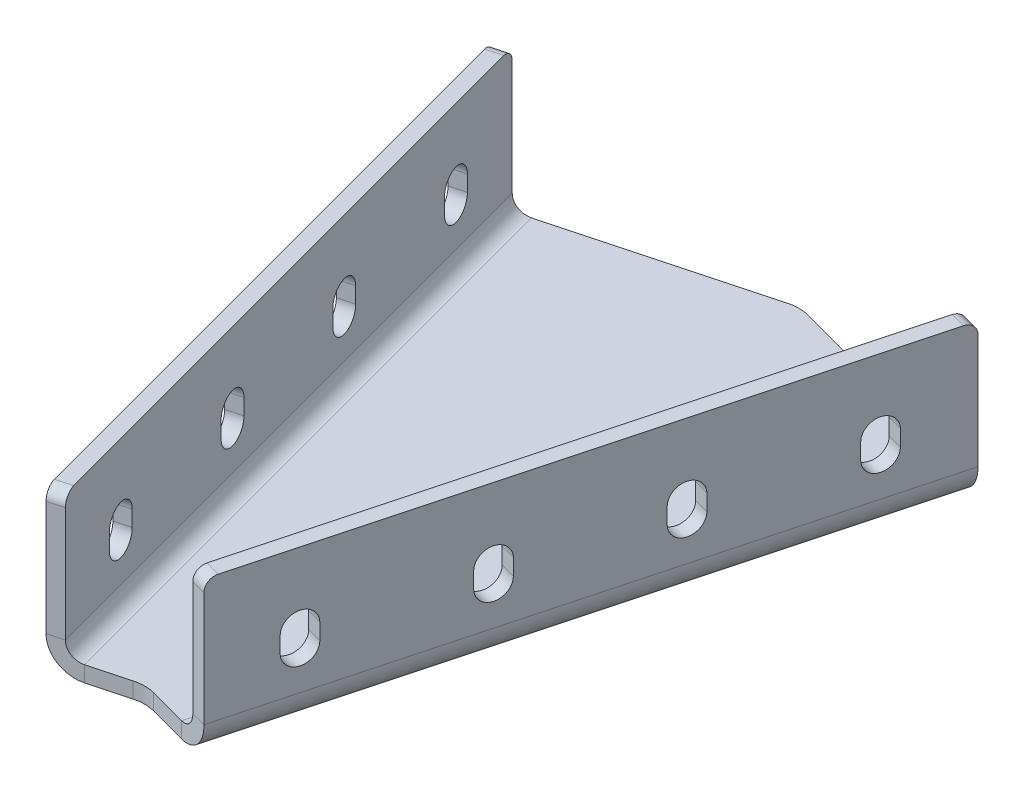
ISO-10303-21;
HEADER;
FILE_DESCRIPTION(('STEP AP214'),'2;1');
FILE_NAME('part.step','',(''),(''),'','','');
FILE_SCHEMA(('AUTOMOTIVE_DESIGN { 1 0 10303 214 1 1 1 1 }'));
ENDSEC;
DATA;
#1=APPLICATION_CONTEXT('core data for automotive mechanical design processes');
#2=APPLICATION_PROTOCOL_DEFINITION('international standard','automotive_design',2000,#1);
#3=PRODUCT_CONTEXT('',#1,'mechanical');
#4=PRODUCT('Part','Part','',(#3));
#5=PRODUCT_RELATED_PRODUCT_CATEGORY('part','',(#4));
#6=PRODUCT_DEFINITION_FORMATION('','',#4);
#7=PRODUCT_DEFINITION_CONTEXT('part definition',#1,'design');
#8=PRODUCT_DEFINITION('design','',#6,#7);
#9=PRODUCT_DEFINITION_SHAPE('','',#8);
#10=(LENGTH_UNIT() NAMED_UNIT(*) SI_UNIT(.MILLI.,.METRE.));
#11=(NAMED_UNIT(*) PLANE_ANGLE_UNIT() SI_UNIT($,.RADIAN.));
#12=(NAMED_UNIT(*) SI_UNIT($,.STERADIAN.) SOLID_ANGLE_UNIT());
#13=UNCERTAINTY_MEASURE_WITH_UNIT(LENGTH_MEASURE(1.E-05),#10,'distance_accuracy_value','');
#14=(GEOMETRIC_REPRESENTATION_CONTEXT(3) GLOBAL_UNCERTAINTY_ASSIGNED_CONTEXT((#13)) GLOBAL_UNIT_ASSIGNED_CONTEXT((#10,
#11,#12)) REPRESENTATION_CONTEXT('',''));
#15=CARTESIAN_POINT('',(0.,0.,0.));
#16=DIRECTION('',(0.,0.,1.));
#17=DIRECTION('',(1.,0.,0.));
#18=AXIS2_PLACEMENT_3D('',#15,#16,#17);
#19=CARTESIAN_POINT('',(0.,-4.,0.));
#20=DIRECTION('',(0.,1.,0.));
#21=DIRECTION('',(0.,0.,1.));
#22=AXIS2_PLACEMENT_3D('',#19,#20,#21);
#23=PLANE('',#22);
#24=DIRECTION('',(-0.965925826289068,0.,0.258819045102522));
#25=VECTOR('',#24,1.);
#26=CARTESIAN_POINT('',(-57.5450000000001,-4.,-150.220863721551));
#27=LINE('',#26,#25);
#28=CARTESIAN_POINT('',(-2.58819045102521,-4.,-164.94649645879));
#29=VERTEX_POINT('',#28);
#30=CARTESIAN_POINT('',(-53.6812966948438,-4.,-151.256139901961));
#31=VERTEX_POINT('',#30);
#32=EDGE_CURVE('E741',#29,#31,#27,.T.);
#33=ORIENTED_EDGE('',*,*,#32,.F.);
#34=CARTESIAN_POINT('',(0.,-4.,-155.287238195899));
#35=DIRECTION('',(0.,1.,0.));
#36=DIRECTION('',(0.,0.,1.));
#37=AXIS2_PLACEMENT_3D('',#34,#35,#36);
#38=CIRCLE('',#37,10.);
#39=CARTESIAN_POINT('',(2.58819045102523,-4.,-164.94649645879));
#40=VERTEX_POINT('',#39);
#41=EDGE_CURVE('E758',#29,#40,#38,.F.);
#42=ORIENTED_EDGE('',*,*,#41,.T.);
#43=DIRECTION('',(-0.965925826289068,0.,-0.258819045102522));
#44=VECTOR('',#43,1.);
#45=CARTESIAN_POINT('',(57.5450000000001,-4.,-150.220863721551));
#46=LINE('',#45,#44);
#47=CARTESIAN_POINT('',(53.6812966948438,-4.00000000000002,-151.256139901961));
#48=VERTEX_POINT('',#47);
#49=EDGE_CURVE('E738',#48,#40,#46,.T.);
#50=ORIENTED_EDGE('',*,*,#49,.F.);
#51=DIRECTION('',(0.258819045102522,0.,-0.965925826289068));
#52=VECTOR('',#51,1.);
#53=CARTESIAN_POINT('',(53.6812966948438,-4.00000000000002,-151.256139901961));
#54=LINE('',#53,#52);
#55=CARTESIAN_POINT('',(12.2712966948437,-4.,3.28808403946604));
#56=VERTEX_POINT('',#55);
#57=EDGE_CURVE('E657',#48,#56,#54,.F.);
#58=ORIENTED_EDGE('',*,*,#57,.T.);
#59=DIRECTION('',(0.965925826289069,0.,0.258819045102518));
#60=VECTOR('',#59,1.);
#61=CARTESIAN_POINT('',(16.135,-4.,4.32336021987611));
#62=LINE('',#61,#60);
#63=CARTESIAN_POINT('',(2.58819045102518,-4.,0.693503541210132));
#64=VERTEX_POINT('',#63);
#65=EDGE_CURVE('E735',#64,#56,#62,.T.);
#66=ORIENTED_EDGE('',*,*,#65,.F.);
#67=CARTESIAN_POINT('',(0.,-4.,10.3527618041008));
#68=DIRECTION('',(0.,1.,0.));
#69=DIRECTION('',(0.,0.,1.));
#70=AXIS2_PLACEMENT_3D('',#67,#68,#69);
#71=CIRCLE('',#70,10.);
#72=CARTESIAN_POINT('',(-2.58819045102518,-4.,0.693503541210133));
#73=VERTEX_POINT('',#72);
#74=EDGE_CURVE('E767',#64,#73,#71,.T.);
#75=ORIENTED_EDGE('',*,*,#74,.T.);
#76=DIRECTION('',(0.965925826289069,0.,-0.258819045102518));
#77=VECTOR('',#76,1.);
#78=CARTESIAN_POINT('',(-16.135,-4.,4.32336021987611));
#79=LINE('',#78,#77);
#80=CARTESIAN_POINT('',(-12.2712966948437,-4.00000000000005,3.28808403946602));
#81=VERTEX_POINT('',#80);
#82=EDGE_CURVE('E732',#81,#73,#79,.T.);
#83=ORIENTED_EDGE('',*,*,#82,.F.);
#84=DIRECTION('',(0.258819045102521,0.,0.965925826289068));
#85=VECTOR('',#84,1.);
#86=CARTESIAN_POINT('',(-12.2712966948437,-4.00000000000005,3.28808403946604));
#87=LINE('',#86,#85);
#88=EDGE_CURVE('E708',#81,#31,#87,.F.);
#89=ORIENTED_EDGE('',*,*,#88,.T.);
#90=EDGE_LOOP('',(#33,#42,#50,#58,#66,#75,#83,#89));
#91=FACE_BOUND('',#90,.T.);
#92=ADVANCED_FACE('F40',(#91),#23,.F.);
#93=CARTESIAN_POINT('',(0.,0.,0.));
#94=DIRECTION('',(0.,1.,0.));
#95=DIRECTION('',(0.,0.,1.));
#96=AXIS2_PLACEMENT_3D('',#93,#94,#95);
#97=PLANE('',#96);
#98=DIRECTION('',(-0.965925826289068,0.,-0.258819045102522));
#99=VECTOR('',#98,1.);
#100=CARTESIAN_POINT('',(57.5450000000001,0.,-150.220863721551));
#101=LINE('',#100,#99);
#102=CARTESIAN_POINT('',(53.6812966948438,0.,-151.256139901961));
#103=VERTEX_POINT('',#102);
#104=CARTESIAN_POINT('',(2.58819045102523,0.,-164.94649645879));
#105=VERTEX_POINT('',#104);
#106=EDGE_CURVE('E748',#103,#105,#101,.T.);
#107=ORIENTED_EDGE('',*,*,#106,.T.);
#108=CARTESIAN_POINT('',(0.,0.,-155.287238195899));
#109=DIRECTION('',(0.,1.,0.));
#110=DIRECTION('',(0.,0.,1.));
#111=AXIS2_PLACEMENT_3D('',#108,#109,#110);
#112=CIRCLE('',#111,10.);
#113=CARTESIAN_POINT('',(-2.58819045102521,0.,-164.94649645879));
#114=VERTEX_POINT('',#113);
#115=EDGE_CURVE('E754',#105,#114,#112,.T.);
#116=ORIENTED_EDGE('',*,*,#115,.T.);
#117=DIRECTION('',(-0.965925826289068,0.,0.258819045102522));
#118=VECTOR('',#117,1.);
#119=CARTESIAN_POINT('',(-57.5450000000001,0.,-150.220863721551));
#120=LINE('',#119,#118);
#121=CARTESIAN_POINT('',(-53.6812966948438,0.,-151.256139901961));
#122=VERTEX_POINT('',#121);
#123=EDGE_CURVE('E736',#114,#122,#120,.T.);
#124=ORIENTED_EDGE('',*,*,#123,.T.);
#125=DIRECTION('',(0.258819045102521,0.,0.965925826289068));
#126=VECTOR('',#125,1.);
#127=CARTESIAN_POINT('',(-12.2712966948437,0.,3.28808403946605));
#128=LINE('',#127,#126);
#129=CARTESIAN_POINT('',(-12.2712966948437,0.,3.28808403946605));
#130=VERTEX_POINT('',#129);
#131=EDGE_CURVE('E721',#130,#122,#128,.F.);
#132=ORIENTED_EDGE('',*,*,#131,.F.);
#133=DIRECTION('',(0.965925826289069,0.,-0.258819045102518));
#134=VECTOR('',#133,1.);
#135=CARTESIAN_POINT('',(-16.135,0.,4.32336021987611));
#136=LINE('',#135,#134);
#137=CARTESIAN_POINT('',(-2.58819045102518,0.,0.693503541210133));
#138=VERTEX_POINT('',#137);
#139=EDGE_CURVE('E729',#130,#138,#136,.T.);
#140=ORIENTED_EDGE('',*,*,#139,.T.);
#141=CARTESIAN_POINT('',(0.,0.,10.3527618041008));
#142=DIRECTION('',(0.,1.,0.));
#143=DIRECTION('',(0.,0.,1.));
#144=AXIS2_PLACEMENT_3D('',#141,#142,#143);
#145=CIRCLE('',#144,10.);
#146=CARTESIAN_POINT('',(2.58819045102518,0.,0.693503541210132));
#147=VERTEX_POINT('',#146);
#148=EDGE_CURVE('E765',#138,#147,#145,.F.);
#149=ORIENTED_EDGE('',*,*,#148,.T.);
#150=DIRECTION('',(0.965925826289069,0.,0.258819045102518));
#151=VECTOR('',#150,1.);
#152=CARTESIAN_POINT('',(16.135,0.,4.32336021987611));
#153=LINE('',#152,#151);
#154=CARTESIAN_POINT('',(12.2712966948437,0.,3.28808403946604));
#155=VERTEX_POINT('',#154);
#156=EDGE_CURVE('E746',#147,#155,#153,.T.);
#157=ORIENTED_EDGE('',*,*,#156,.T.);
#158=DIRECTION('',(0.258819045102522,0.,-0.965925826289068));
#159=VECTOR('',#158,1.);
#160=CARTESIAN_POINT('',(53.6812966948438,0.,-151.256139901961));
#161=LINE('',#160,#159);
#162=EDGE_CURVE('E670',#103,#155,#161,.F.);
#163=ORIENTED_EDGE('',*,*,#162,.F.);
#164=EDGE_LOOP('',(#107,#116,#124,#132,#140,#149,#157,#163));
#165=FACE_BOUND('',#164,.T.);
#166=ADVANCED_FACE('F846',(#165),#97,.T.);
#167=CARTESIAN_POINT('',(57.5450000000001,-4.,-150.220863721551));
#168=DIRECTION('',(0.258819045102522,0.,-0.965925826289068));
#169=DIRECTION('',(-0.965925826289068,0.,-0.258819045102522));
#170=AXIS2_PLACEMENT_3D('',#167,#168,#169);
#171=PLANE('',#170);
#172=ORIENTED_EDGE('',*,*,#49,.T.);
#173=DIRECTION('',(0.,1.,0.));
#174=VECTOR('',#173,1.);
#175=CARTESIAN_POINT('',(2.58819045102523,-4.,-164.94649645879));
#176=LINE('',#175,#174);
#177=EDGE_CURVE('E743',#40,#105,#176,.T.);
#178=ORIENTED_EDGE('',*,*,#177,.T.);
#179=ORIENTED_EDGE('',*,*,#106,.F.);
#180=DIRECTION('',(0.,-1.,0.));
#181=VECTOR('',#180,1.);
#182=CARTESIAN_POINT('',(53.6812966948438,0.,-151.256139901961));
#183=LINE('',#182,#181);
#184=EDGE_CURVE('E664',#103,#48,#183,.T.);
#185=ORIENTED_EDGE('',*,*,#184,.T.);
#186=EDGE_LOOP('',(#172,#178,#179,#185));
#187=FACE_BOUND('',#186,.T.);
#188=ADVANCED_FACE('F852',(#187),#171,.T.);
#189=CARTESIAN_POINT('',(-16.135,-4.,4.32336021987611));
#190=DIRECTION('',(0.258819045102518,0.,0.965925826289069));
#191=DIRECTION('',(0.965925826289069,0.,-0.258819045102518));
#192=AXIS2_PLACEMENT_3D('',#189,#190,#191);
#193=PLANE('',#192);
#194=ORIENTED_EDGE('',*,*,#82,.T.);
#195=DIRECTION('',(0.,1.,0.));
#196=VECTOR('',#195,1.);
#197=CARTESIAN_POINT('',(-2.58819045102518,0.,0.693503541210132));
#198=LINE('',#197,#196);
#199=EDGE_CURVE('E760',#73,#138,#198,.T.);
#200=ORIENTED_EDGE('',*,*,#199,.T.);
#201=ORIENTED_EDGE('',*,*,#139,.F.);
#202=DIRECTION('',(0.,-1.,0.));
#203=VECTOR('',#202,1.);
#204=CARTESIAN_POINT('',(-12.2712966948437,0.,3.28808403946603));
#205=LINE('',#204,#203);
#206=EDGE_CURVE('E715',#130,#81,#205,.T.);
#207=ORIENTED_EDGE('',*,*,#206,.T.);
#208=EDGE_LOOP('',(#194,#200,#201,#207));
#209=FACE_BOUND('',#208,.T.);
#210=ADVANCED_FACE('F864',(#209),#193,.T.);
#211=CARTESIAN_POINT('',(-57.5450000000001,-4.,-150.220863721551));
#212=DIRECTION('',(-0.258819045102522,0.,-0.965925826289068));
#213=DIRECTION('',(-0.965925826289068,0.,0.258819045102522));
#214=AXIS2_PLACEMENT_3D('',#211,#212,#213);
#215=PLANE('',#214);
#216=ORIENTED_EDGE('',*,*,#123,.F.);
#217=DIRECTION('',(0.,1.,0.));
#218=VECTOR('',#217,1.);
#219=CARTESIAN_POINT('',(-2.58819045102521,-4.,-164.94649645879));
#220=LINE('',#219,#218);
#221=EDGE_CURVE('E756',#114,#29,#220,.F.);
#222=ORIENTED_EDGE('',*,*,#221,.T.);
#223=ORIENTED_EDGE('',*,*,#32,.T.);
#224=DIRECTION('',(0.,-1.,0.));
#225=VECTOR('',#224,1.);
#226=CARTESIAN_POINT('',(-53.6812966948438,0.,-151.256139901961));
#227=LINE('',#226,#225);
#228=EDGE_CURVE('E726',#122,#31,#227,.T.);
#229=ORIENTED_EDGE('',*,*,#228,.F.);
#230=EDGE_LOOP('',(#216,#222,#223,#229));
#231=FACE_BOUND('',#230,.T.);
#232=ADVANCED_FACE('F860',(#231),#215,.T.);
#233=CARTESIAN_POINT('',(16.135,-4.,4.32336021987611));
#234=DIRECTION('',(-0.258819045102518,0.,0.965925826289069));
#235=DIRECTION('',(0.965925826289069,0.,0.258819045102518));
#236=AXIS2_PLACEMENT_3D('',#233,#234,#235);
#237=PLANE('',#236);
#238=ORIENTED_EDGE('',*,*,#156,.F.);
#239=DIRECTION('',(0.,1.,0.));
#240=VECTOR('',#239,1.);
#241=CARTESIAN_POINT('',(2.58819045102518,-4.,0.693503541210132));
#242=LINE('',#241,#240);
#243=EDGE_CURVE('E763',#147,#64,#242,.F.);
#244=ORIENTED_EDGE('',*,*,#243,.T.);
#245=ORIENTED_EDGE('',*,*,#65,.T.);
#246=DIRECTION('',(0.,-1.,0.));
#247=VECTOR('',#246,1.);
#248=CARTESIAN_POINT('',(12.2712966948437,0.,3.28808403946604));
#249=LINE('',#248,#247);
#250=EDGE_CURVE('E675',#155,#56,#249,.T.);
#251=ORIENTED_EDGE('',*,*,#250,.F.);
#252=EDGE_LOOP('',(#238,#244,#245,#251));
#253=FACE_BOUND('',#252,.T.);
#254=ADVANCED_FACE('F863',(#253),#237,.T.);
#255=CARTESIAN_POINT('',(-53.6812966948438,4.,-151.256139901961));
#256=DIRECTION('',(-0.258819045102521,0.,-0.965925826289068));
#257=DIRECTION('',(-0.965925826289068,0.,0.258819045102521));
#258=AXIS2_PLACEMENT_3D('',#255,#256,#257);
#259=PLANE('',#258);
#260=DIRECTION('',(-0.965925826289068,0.,0.258819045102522));
#261=VECTOR('',#260,1.);
#262=CARTESIAN_POINT('',(-57.5450000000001,3.99999999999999,-150.220863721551));
#263=LINE('',#262,#261);
#264=CARTESIAN_POINT('',(-57.5450000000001,3.99999999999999,-150.220863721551));
#265=VERTEX_POINT('',#264);
#266=CARTESIAN_POINT('',(-61.4087033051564,3.99999999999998,-149.185587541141));
#267=VERTEX_POINT('',#266);
#268=EDGE_CURVE('E678',#265,#267,#263,.T.);
#269=ORIENTED_EDGE('',*,*,#268,.F.);
#270=CARTESIAN_POINT('',(-53.6812966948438,4.,-151.256139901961));
#271=DIRECTION('',(0.258819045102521,0.,0.965925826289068));
#272=DIRECTION('',(0.965925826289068,0.,-0.258819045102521));
#273=AXIS2_PLACEMENT_3D('',#270,#271,#272);
#274=CIRCLE('',#273,4.00000000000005);
#275=EDGE_CURVE('E718',#122,#265,#274,.F.);
#276=ORIENTED_EDGE('',*,*,#275,.F.);
#277=ORIENTED_EDGE('',*,*,#228,.T.);
#278=CARTESIAN_POINT('',(-53.6812966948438,4.,-151.256139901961));
#279=DIRECTION('',(0.258819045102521,0.,0.965925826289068));
#280=DIRECTION('',(0.965925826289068,0.,-0.258819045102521));
#281=AXIS2_PLACEMENT_3D('',#278,#279,#280);
#282=CIRCLE('',#281,8.00000000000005);
#283=EDGE_CURVE('E711',#31,#267,#282,.F.);
#284=ORIENTED_EDGE('',*,*,#283,.T.);
#285=EDGE_LOOP('',(#269,#276,#277,#284));
#286=FACE_BOUND('',#285,.T.);
#287=ADVANCED_FACE('F871',(#286),#259,.T.);
#288=CARTESIAN_POINT('',(-12.2712966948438,4.,3.28808403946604));
#289=DIRECTION('',(-0.258819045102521,0.,-0.965925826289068));
#290=DIRECTION('',(-0.965925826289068,0.,0.258819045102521));
#291=AXIS2_PLACEMENT_3D('',#288,#289,#290);
#292=PLANE('',#291);
#293=CARTESIAN_POINT('',(-12.2712966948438,4.,3.28808403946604));
#294=DIRECTION('',(0.258819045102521,0.,0.965925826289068));
#295=DIRECTION('',(0.965925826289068,0.,-0.258819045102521));
#296=AXIS2_PLACEMENT_3D('',#293,#294,#295);
#297=CIRCLE('',#296,4.00000000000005);
#298=CARTESIAN_POINT('',(-16.1350000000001,3.99999999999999,4.32336021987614));
#299=VERTEX_POINT('',#298);
#300=EDGE_CURVE('E701',#299,#130,#297,.T.);
#301=ORIENTED_EDGE('',*,*,#300,.F.);
#302=DIRECTION('',(-0.965925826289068,0.,0.258819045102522));
#303=VECTOR('',#302,1.);
#304=CARTESIAN_POINT('',(-16.135,3.99999999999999,4.32336021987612));
#305=LINE('',#304,#303);
#306=CARTESIAN_POINT('',(-19.9987033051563,3.99999999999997,5.3586364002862));
#307=VERTEX_POINT('',#306);
#308=EDGE_CURVE('E683',#299,#307,#305,.T.);
#309=ORIENTED_EDGE('',*,*,#308,.T.);
#310=CARTESIAN_POINT('',(-12.2712966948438,4.,3.28808403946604));
#311=DIRECTION('',(0.258819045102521,0.,0.965925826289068));
#312=DIRECTION('',(0.965925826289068,0.,-0.258819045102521));
#313=AXIS2_PLACEMENT_3D('',#310,#311,#312);
#314=CIRCLE('',#313,8.00000000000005);
#315=EDGE_CURVE('E712',#307,#81,#314,.T.);
#316=ORIENTED_EDGE('',*,*,#315,.T.);
#317=ORIENTED_EDGE('',*,*,#206,.F.);
#318=EDGE_LOOP('',(#301,#309,#316,#317));
#319=FACE_BOUND('',#318,.T.);
#320=ADVANCED_FACE('F857',(#319),#292,.F.);
#321=CARTESIAN_POINT('',(-12.2712966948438,4.,3.28808403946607));
#322=DIRECTION('',(0.258819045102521,0.,0.965925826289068));
#323=DIRECTION('',(-0.965925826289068,0.,0.258819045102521));
#324=AXIS2_PLACEMENT_3D('',#321,#322,#323);
#325=CYLINDRICAL_SURFACE('',#324,8.00000000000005);
#326=ORIENTED_EDGE('',*,*,#88,.F.);
#327=ORIENTED_EDGE('',*,*,#315,.F.);
#328=DIRECTION('',(-0.258819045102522,0.,-0.965925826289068));
#329=VECTOR('',#328,1.);
#330=CARTESIAN_POINT('',(-19.9987033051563,3.99999999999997,5.35863640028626));
#331=LINE('',#330,#329);
#332=EDGE_CURVE('E686',#307,#267,#331,.T.);
#333=ORIENTED_EDGE('',*,*,#332,.T.);
#334=ORIENTED_EDGE('',*,*,#283,.F.);
#335=EDGE_LOOP('',(#326,#327,#333,#334));
#336=FACE_BOUND('',#335,.T.);
#337=ADVANCED_FACE('F935',(#336),#325,.T.);
#338=CARTESIAN_POINT('',(-12.2712966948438,4.,3.28808403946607));
#339=DIRECTION('',(0.258819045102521,0.,0.965925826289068));
#340=DIRECTION('',(-0.965925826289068,0.,0.258819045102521));
#341=AXIS2_PLACEMENT_3D('',#338,#339,#340);
#342=CYLINDRICAL_SURFACE('',#341,4.00000000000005);
#343=ORIENTED_EDGE('',*,*,#131,.T.);
#344=ORIENTED_EDGE('',*,*,#275,.T.);
#345=DIRECTION('',(0.258819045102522,0.,0.965925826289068));
#346=VECTOR('',#345,1.);
#347=CARTESIAN_POINT('',(-57.5450000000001,3.99999999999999,-150.220863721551));
#348=LINE('',#347,#346);
#349=EDGE_CURVE('E681',#265,#299,#348,.T.);
#350=ORIENTED_EDGE('',*,*,#349,.T.);
#351=ORIENTED_EDGE('',*,*,#300,.T.);
#352=EDGE_LOOP('',(#343,#344,#350,#351));
#353=FACE_BOUND('',#352,.T.);
#354=ADVANCED_FACE('F905',(#353),#342,.F.);
#355=CARTESIAN_POINT('',(-19.9987033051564,36.,5.35863640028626));
#356=DIRECTION('',(-0.258819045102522,0.,-0.965925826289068));
#357=DIRECTION('',(-0.965925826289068,0.,0.258819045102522));
#358=AXIS2_PLACEMENT_3D('',#355,#356,#357);
#359=PLANE('',#358);
#360=DIRECTION('',(0.,1.,0.));
#361=VECTOR('',#360,1.);
#362=CARTESIAN_POINT('',(-16.1350000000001,36.,4.32336021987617));
#363=LINE('',#362,#361);
#364=CARTESIAN_POINT('',(-16.1350000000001,33.,4.32336021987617));
#365=VERTEX_POINT('',#364);
#366=EDGE_CURVE('E691',#299,#365,#363,.T.);
#367=ORIENTED_EDGE('',*,*,#366,.T.);
#368=DIRECTION('',(0.965925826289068,0.,-0.258819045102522));
#369=VECTOR('',#368,1.);
#370=CARTESIAN_POINT('',(-19.9987033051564,33.,5.35863640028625));
#371=LINE('',#370,#369);
#372=CARTESIAN_POINT('',(-19.9987033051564,33.,5.35863640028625));
#373=VERTEX_POINT('',#372);
#374=EDGE_CURVE('E11',#365,#373,#371,.F.);
#375=ORIENTED_EDGE('',*,*,#374,.T.);
#376=DIRECTION('',(0.,1.,0.));
#377=VECTOR('',#376,1.);
#378=CARTESIAN_POINT('',(-19.9987033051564,36.,5.35863640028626));
#379=LINE('',#378,#377);
#380=EDGE_CURVE('E692',#307,#373,#379,.T.);
#381=ORIENTED_EDGE('',*,*,#380,.F.);
#382=ORIENTED_EDGE('',*,*,#308,.F.);
#383=EDGE_LOOP('',(#367,#375,#381,#382));
#384=FACE_BOUND('',#383,.T.);
#385=ADVANCED_FACE('F914',(#384),#359,.F.);
#386=CARTESIAN_POINT('',(-61.4087033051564,0.,-149.185587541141));
#387=DIRECTION('',(0.258819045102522,0.,0.965925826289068));
#388=DIRECTION('',(0.965925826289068,0.,-0.258819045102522));
#389=AXIS2_PLACEMENT_3D('',#386,#387,#388);
#390=PLANE('',#389);
#391=DIRECTION('',(0.,-1.,0.));
#392=VECTOR('',#391,1.);
#393=CARTESIAN_POINT('',(-61.4087033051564,0.,-149.185587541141));
#394=LINE('',#393,#392);
#395=CARTESIAN_POINT('',(-61.4087033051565,33.,-149.185587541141));
#396=VERTEX_POINT('',#395);
#397=EDGE_CURVE('E699',#396,#267,#394,.T.);
#398=ORIENTED_EDGE('',*,*,#397,.F.);
#399=DIRECTION('',(0.965925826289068,0.,-0.258819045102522));
#400=VECTOR('',#399,1.);
#401=CARTESIAN_POINT('',(-61.4087033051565,33.,-149.185587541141));
#402=LINE('',#401,#400);
#403=CARTESIAN_POINT('',(-57.5450000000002,33.,-150.220863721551));
#404=VERTEX_POINT('',#403);
#405=EDGE_CURVE('E769',#396,#404,#402,.T.);
#406=ORIENTED_EDGE('',*,*,#405,.T.);
#407=DIRECTION('',(0.,-1.,0.));
#408=VECTOR('',#407,1.);
#409=CARTESIAN_POINT('',(-57.5450000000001,0.,-150.220863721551));
#410=LINE('',#409,#408);
#411=EDGE_CURVE('E696',#404,#265,#410,.T.);
#412=ORIENTED_EDGE('',*,*,#411,.T.);
#413=ORIENTED_EDGE('',*,*,#268,.T.);
#414=EDGE_LOOP('',(#398,#406,#412,#413));
#415=FACE_BOUND('',#414,.T.);
#416=ADVANCED_FACE('F897',(#415),#390,.F.);
#417=CARTESIAN_POINT('',(-19.9987033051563,0.,5.35863640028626));
#418=DIRECTION('',(0.965925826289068,0.,-0.258819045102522));
#419=DIRECTION('',(-0.258819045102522,0.,-0.965925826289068));
#420=AXIS2_PLACEMENT_3D('',#417,#418,#419);
#421=PLANE('',#420);
#422=DIRECTION('',(0.,-1.,0.));
#423=VECTOR('',#422,1.);
#424=CARTESIAN_POINT('',(-26.1974194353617,17.9999999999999,-17.7752871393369));
#425=LINE('',#424,#423);
#426=CARTESIAN_POINT('',(-26.1974194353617,18.,-17.7752871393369));
#427=VERTEX_POINT('',#426);
#428=CARTESIAN_POINT('',(-26.1974194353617,13.9999999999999,-17.7752871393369));
#429=VERTEX_POINT('',#428);
#430=EDGE_CURVE('E518',#427,#429,#425,.T.);
#431=ORIENTED_EDGE('',*,*,#430,.F.);
#432=CARTESIAN_POINT('',(-25.1362613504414,17.9999999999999,-13.8149912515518));
#433=DIRECTION('',(-0.965925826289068,0.,0.258819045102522));
#434=DIRECTION('',(0.258819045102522,0.,0.965925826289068));
#435=AXIS2_PLACEMENT_3D('',#432,#433,#434);
#436=CIRCLE('',#435,4.1);
#437=CARTESIAN_POINT('',(-24.075103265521,17.9999999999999,-9.85469536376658));
#438=VERTEX_POINT('',#437);
#439=EDGE_CURVE('E516',#438,#427,#436,.T.);
#440=ORIENTED_EDGE('',*,*,#439,.F.);
#441=DIRECTION('',(0.,1.,0.));
#442=VECTOR('',#441,1.);
#443=CARTESIAN_POINT('',(-24.075103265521,17.9999999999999,-9.85469536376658));
#444=LINE('',#443,#442);
#445=CARTESIAN_POINT('',(-24.075103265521,13.9999999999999,-9.85469536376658));
#446=VERTEX_POINT('',#445);
#447=EDGE_CURVE('E506',#446,#438,#444,.T.);
#448=ORIENTED_EDGE('',*,*,#447,.F.);
#449=CARTESIAN_POINT('',(-25.1362613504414,13.9999999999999,-13.8149912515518));
#450=DIRECTION('',(-0.965925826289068,0.,0.258819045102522));
#451=DIRECTION('',(0.258819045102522,0.,0.965925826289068));
#452=AXIS2_PLACEMENT_3D('',#449,#450,#451);
#453=CIRCLE('',#452,4.1);
#454=EDGE_CURVE('E522',#429,#446,#453,.T.);
#455=ORIENTED_EDGE('',*,*,#454,.F.);
#456=EDGE_LOOP('',(#431,#440,#448,#455));
#457=FACE_BOUND('',#456,.T.);
#458=DIRECTION('',(0.,-1.,0.));
#459=VECTOR('',#458,1.);
#460=CARTESIAN_POINT('',(-36.5501812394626,17.999999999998,-56.4123201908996));
#461=LINE('',#460,#459);
#462=CARTESIAN_POINT('',(-36.5501812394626,17.999999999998,-56.4123201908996));
#463=VERTEX_POINT('',#462);
#464=CARTESIAN_POINT('',(-36.5501812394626,13.999999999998,-56.4123201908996));
#465=VERTEX_POINT('',#464);
#466=EDGE_CURVE('E552',#463,#465,#461,.T.);
#467=ORIENTED_EDGE('',*,*,#466,.F.);
#468=CARTESIAN_POINT('',(-35.4890231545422,17.999999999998,-52.4520243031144));
#469=DIRECTION('',(-0.965925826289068,0.,0.258819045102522));
#470=DIRECTION('',(0.258819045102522,0.,0.965925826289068));
#471=AXIS2_PLACEMENT_3D('',#468,#469,#470);
#472=CIRCLE('',#471,4.10000000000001);
#473=CARTESIAN_POINT('',(-34.4278650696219,17.999999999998,-48.4917284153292));
#474=VERTEX_POINT('',#473);
#475=EDGE_CURVE('E550',#474,#463,#472,.T.);
#476=ORIENTED_EDGE('',*,*,#475,.F.);
#477=DIRECTION('',(0.,1.,0.));
#478=VECTOR('',#477,1.);
#479=CARTESIAN_POINT('',(-34.4278650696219,17.999999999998,-48.4917284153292));
#480=LINE('',#479,#478);
#481=CARTESIAN_POINT('',(-34.4278650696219,13.999999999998,-48.4917284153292));
#482=VERTEX_POINT('',#481);
#483=EDGE_CURVE('E540',#482,#474,#480,.T.);
#484=ORIENTED_EDGE('',*,*,#483,.F.);
#485=CARTESIAN_POINT('',(-35.4890231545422,13.999999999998,-52.4520243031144));
#486=DIRECTION('',(-0.965925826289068,0.,0.258819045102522));
#487=DIRECTION('',(0.258819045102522,0.,0.965925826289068));
#488=AXIS2_PLACEMENT_3D('',#485,#486,#487);
#489=CIRCLE('',#488,4.10000000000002);
#490=EDGE_CURVE('E556',#465,#482,#489,.T.);
#491=ORIENTED_EDGE('',*,*,#490,.F.);
#492=EDGE_LOOP('',(#467,#476,#484,#491));
#493=FACE_BOUND('',#492,.T.);
#494=DIRECTION('',(0.,-1.,0.));
#495=VECTOR('',#494,1.);
#496=CARTESIAN_POINT('',(-46.9029430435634,17.999999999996,-95.0493532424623));
#497=LINE('',#496,#495);
#498=CARTESIAN_POINT('',(-46.9029430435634,17.999999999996,-95.0493532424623));
#499=VERTEX_POINT('',#498);
#500=CARTESIAN_POINT('',(-46.9029430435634,13.999999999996,-95.0493532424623));
#501=VERTEX_POINT('',#500);
#502=EDGE_CURVE('E584',#499,#501,#497,.T.);
#503=ORIENTED_EDGE('',*,*,#502,.F.);
#504=CARTESIAN_POINT('',(-45.8417849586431,17.999999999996,-91.0890573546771));
#505=DIRECTION('',(-0.965925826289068,0.,0.258819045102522));
#506=DIRECTION('',(0.258819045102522,0.,0.965925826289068));
#507=AXIS2_PLACEMENT_3D('',#504,#505,#506);
#508=CIRCLE('',#507,4.09999999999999);
#509=CARTESIAN_POINT('',(-44.7806268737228,17.999999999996,-87.128761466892));
#510=VERTEX_POINT('',#509);
#511=EDGE_CURVE('E582',#510,#499,#508,.T.);
#512=ORIENTED_EDGE('',*,*,#511,.F.);
#513=DIRECTION('',(0.,1.,0.));
#514=VECTOR('',#513,1.);
#515=CARTESIAN_POINT('',(-44.7806268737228,17.999999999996,-87.128761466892));
#516=LINE('',#515,#514);
#517=CARTESIAN_POINT('',(-44.7806268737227,13.999999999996,-87.128761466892));
#518=VERTEX_POINT('',#517);
#519=EDGE_CURVE('E572',#518,#510,#516,.T.);
#520=ORIENTED_EDGE('',*,*,#519,.F.);
#521=CARTESIAN_POINT('',(-45.8417849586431,13.999999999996,-91.0890573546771));
#522=DIRECTION('',(-0.965925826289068,0.,0.258819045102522));
#523=DIRECTION('',(0.258819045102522,0.,0.965925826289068));
#524=AXIS2_PLACEMENT_3D('',#521,#522,#523);
#525=CIRCLE('',#524,4.09999999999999);
#526=EDGE_CURVE('E588',#501,#518,#525,.T.);
#527=ORIENTED_EDGE('',*,*,#526,.F.);
#528=EDGE_LOOP('',(#503,#512,#520,#527));
#529=FACE_BOUND('',#528,.T.);
#530=DIRECTION('',(0.,-1.,0.));
#531=VECTOR('',#530,1.);
#532=CARTESIAN_POINT('',(-57.2557048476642,17.999999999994,-133.686386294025));
#533=LINE('',#532,#531);
#534=CARTESIAN_POINT('',(-57.2557048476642,17.999999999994,-133.686386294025));
#535=VERTEX_POINT('',#534);
#536=CARTESIAN_POINT('',(-57.2557048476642,13.999999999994,-133.686386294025));
#537=VERTEX_POINT('',#536);
#538=EDGE_CURVE('E615',#535,#537,#533,.T.);
#539=ORIENTED_EDGE('',*,*,#538,.F.);
#540=CARTESIAN_POINT('',(-56.1945467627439,17.999999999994,-129.72609040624));
#541=DIRECTION('',(-0.965925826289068,0.,0.258819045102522));
#542=DIRECTION('',(0.258819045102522,0.,0.965925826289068));
#543=AXIS2_PLACEMENT_3D('',#540,#541,#542);
#544=CIRCLE('',#543,4.09999999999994);
#545=CARTESIAN_POINT('',(-55.1333886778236,17.999999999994,-125.765794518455));
#546=VERTEX_POINT('',#545);
#547=EDGE_CURVE('E405',#546,#535,#544,.T.);
#548=ORIENTED_EDGE('',*,*,#547,.F.);
#549=DIRECTION('',(0.,1.,0.));
#550=VECTOR('',#549,1.);
#551=CARTESIAN_POINT('',(-55.1333886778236,17.999999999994,-125.765794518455));
#552=LINE('',#551,#550);
#553=CARTESIAN_POINT('',(-55.1333886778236,13.999999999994,-125.765794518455));
#554=VERTEX_POINT('',#553);
#555=EDGE_CURVE('E604',#554,#546,#552,.T.);
#556=ORIENTED_EDGE('',*,*,#555,.F.);
#557=CARTESIAN_POINT('',(-56.1945467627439,13.999999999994,-129.72609040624));
#558=DIRECTION('',(-0.965925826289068,0.,0.258819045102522));
#559=DIRECTION('',(0.258819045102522,0.,0.965925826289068));
#560=AXIS2_PLACEMENT_3D('',#557,#558,#559);
#561=CIRCLE('',#560,4.09999999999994);
#562=EDGE_CURVE('E618',#537,#554,#561,.T.);
#563=ORIENTED_EDGE('',*,*,#562,.F.);
#564=EDGE_LOOP('',(#539,#548,#556,#563));
#565=FACE_BOUND('',#564,.T.);
#566=DIRECTION('',(-0.258819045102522,0.,-0.965925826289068));
#567=VECTOR('',#566,1.);
#568=CARTESIAN_POINT('',(-61.4087033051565,36.,-149.185587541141));
#569=LINE('',#568,#567);
#570=CARTESIAN_POINT('',(-20.7751604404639,36.,2.46085892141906));
#571=VERTEX_POINT('',#570);
#572=CARTESIAN_POINT('',(-60.6322461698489,36.,-146.287810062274));
#573=VERTEX_POINT('',#572);
#574=EDGE_CURVE('E695',#571,#573,#569,.T.);
#575=ORIENTED_EDGE('',*,*,#574,.T.);
#576=CARTESIAN_POINT('',(-60.6322461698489,33.,-146.287810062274));
#577=DIRECTION('',(0.965925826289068,0.,-0.258819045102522));
#578=DIRECTION('',(-0.258819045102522,0.,-0.965925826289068));
#579=AXIS2_PLACEMENT_3D('',#576,#577,#578);
#580=CIRCLE('',#579,3.);
#581=EDGE_CURVE('E783',#573,#396,#580,.F.);
#582=ORIENTED_EDGE('',*,*,#581,.T.);
#583=ORIENTED_EDGE('',*,*,#397,.T.);
#584=ORIENTED_EDGE('',*,*,#332,.F.);
#585=ORIENTED_EDGE('',*,*,#380,.T.);
#586=CARTESIAN_POINT('',(-20.7751604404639,33.,2.46085892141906));
#587=DIRECTION('',(0.965925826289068,0.,-0.258819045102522));
#588=DIRECTION('',(-0.258819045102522,0.,-0.965925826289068));
#589=AXIS2_PLACEMENT_3D('',#586,#587,#588);
#590=CIRCLE('',#589,3.);
#591=EDGE_CURVE('E781',#373,#571,#590,.F.);
#592=ORIENTED_EDGE('',*,*,#591,.T.);
#593=EDGE_LOOP('',(#575,#582,#583,#584,#585,#592));
#594=FACE_BOUND('',#593,.T.);
#595=ADVANCED_FACE('F893',(#457,#493,#529,#565,#594),#421,.F.);
#596=CARTESIAN_POINT('',(-16.135,0.,4.32336021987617));
#597=DIRECTION('',(0.965925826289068,0.,-0.258819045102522));
#598=DIRECTION('',(-0.258819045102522,0.,-0.965925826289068));
#599=AXIS2_PLACEMENT_3D('',#596,#597,#598);
#600=PLANE('',#599);
#601=CARTESIAN_POINT('',(-21.2725580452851,18.,-14.8502674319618));
#602=DIRECTION('',(-0.965925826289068,0.,0.258819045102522));
#603=DIRECTION('',(0.258819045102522,0.,0.965925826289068));
#604=AXIS2_PLACEMENT_3D('',#601,#602,#603);
#605=CIRCLE('',#604,4.1);
#606=CARTESIAN_POINT('',(-20.2113999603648,18.,-10.8899715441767));
#607=VERTEX_POINT('',#606);
#608=CARTESIAN_POINT('',(-22.3337161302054,18.,-18.810563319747));
#609=VERTEX_POINT('',#608);
#610=EDGE_CURVE('E502',#607,#609,#605,.T.);
#611=ORIENTED_EDGE('',*,*,#610,.T.);
#612=DIRECTION('',(0.,-1.,0.));
#613=VECTOR('',#612,1.);
#614=CARTESIAN_POINT('',(-22.3337161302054,18.,-18.810563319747));
#615=LINE('',#614,#613);
#616=CARTESIAN_POINT('',(-22.3337161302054,13.9999999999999,-18.810563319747));
#617=VERTEX_POINT('',#616);
#618=EDGE_CURVE('E505',#609,#617,#615,.T.);
#619=ORIENTED_EDGE('',*,*,#618,.T.);
#620=CARTESIAN_POINT('',(-21.2725580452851,14.,-14.8502674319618));
#621=DIRECTION('',(-0.965925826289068,0.,0.258819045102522));
#622=DIRECTION('',(0.258819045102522,0.,0.965925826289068));
#623=AXIS2_PLACEMENT_3D('',#620,#621,#622);
#624=CIRCLE('',#623,4.1);
#625=CARTESIAN_POINT('',(-20.2113999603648,14.,-10.8899715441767));
#626=VERTEX_POINT('',#625);
#627=EDGE_CURVE('E509',#617,#626,#624,.T.);
#628=ORIENTED_EDGE('',*,*,#627,.T.);
#629=DIRECTION('',(0.,1.,0.));
#630=VECTOR('',#629,1.);
#631=CARTESIAN_POINT('',(-20.2113999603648,18.,-10.8899715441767));
#632=LINE('',#631,#630);
#633=EDGE_CURVE('E512',#626,#607,#632,.T.);
#634=ORIENTED_EDGE('',*,*,#633,.T.);
#635=EDGE_LOOP('',(#611,#619,#628,#634));
#636=FACE_BOUND('',#635,.T.);
#637=CARTESIAN_POINT('',(-31.625319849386,17.999999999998,-53.4873004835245));
#638=DIRECTION('',(-0.965925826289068,0.,0.258819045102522));
#639=DIRECTION('',(0.258819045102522,0.,0.965925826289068));
#640=AXIS2_PLACEMENT_3D('',#637,#638,#639);
#641=CIRCLE('',#640,4.10000000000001);
#642=CARTESIAN_POINT('',(-30.5641617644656,17.999999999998,-49.5270045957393));
#643=VERTEX_POINT('',#642);
#644=CARTESIAN_POINT('',(-32.6864779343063,17.999999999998,-57.4475963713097));
#645=VERTEX_POINT('',#644);
#646=EDGE_CURVE('E536',#643,#645,#641,.T.);
#647=ORIENTED_EDGE('',*,*,#646,.T.);
#648=DIRECTION('',(0.,-1.,0.));
#649=VECTOR('',#648,1.);
#650=CARTESIAN_POINT('',(-32.6864779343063,17.999999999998,-57.4475963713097));
#651=LINE('',#650,#649);
#652=CARTESIAN_POINT('',(-32.6864779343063,13.999999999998,-57.4475963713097));
#653=VERTEX_POINT('',#652);
#654=EDGE_CURVE('E539',#645,#653,#651,.T.);
#655=ORIENTED_EDGE('',*,*,#654,.T.);
#656=CARTESIAN_POINT('',(-31.6253198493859,13.999999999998,-53.4873004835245));
#657=DIRECTION('',(-0.965925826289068,0.,0.258819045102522));
#658=DIRECTION('',(0.258819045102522,0.,0.965925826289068));
#659=AXIS2_PLACEMENT_3D('',#656,#657,#658);
#660=CIRCLE('',#659,4.10000000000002);
#661=CARTESIAN_POINT('',(-30.5641617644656,13.999999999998,-49.5270045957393));
#662=VERTEX_POINT('',#661);
#663=EDGE_CURVE('E543',#653,#662,#660,.T.);
#664=ORIENTED_EDGE('',*,*,#663,.T.);
#665=DIRECTION('',(0.,1.,0.));
#666=VECTOR('',#665,1.);
#667=CARTESIAN_POINT('',(-30.5641617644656,17.999999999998,-49.5270045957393));
#668=LINE('',#667,#666);
#669=EDGE_CURVE('E546',#662,#643,#668,.T.);
#670=ORIENTED_EDGE('',*,*,#669,.T.);
#671=EDGE_LOOP('',(#647,#655,#664,#670));
#672=FACE_BOUND('',#671,.T.);
#673=CARTESIAN_POINT('',(-41.9780816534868,17.999999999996,-92.1243335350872));
#674=DIRECTION('',(-0.965925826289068,0.,0.258819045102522));
#675=DIRECTION('',(0.258819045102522,0.,0.965925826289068));
#676=AXIS2_PLACEMENT_3D('',#673,#674,#675);
#677=CIRCLE('',#676,4.09999999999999);
#678=CARTESIAN_POINT('',(-40.9169235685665,17.999999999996,-88.1640376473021));
#679=VERTEX_POINT('',#678);
#680=CARTESIAN_POINT('',(-43.0392397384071,17.999999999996,-96.0846294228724));
#681=VERTEX_POINT('',#680);
#682=EDGE_CURVE('E568',#679,#681,#677,.T.);
#683=ORIENTED_EDGE('',*,*,#682,.T.);
#684=DIRECTION('',(0.,-1.,0.));
#685=VECTOR('',#684,1.);
#686=CARTESIAN_POINT('',(-43.0392397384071,17.999999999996,-96.0846294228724));
#687=LINE('',#686,#685);
#688=CARTESIAN_POINT('',(-43.0392397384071,13.999999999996,-96.0846294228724));
#689=VERTEX_POINT('',#688);
#690=EDGE_CURVE('E571',#681,#689,#687,.T.);
#691=ORIENTED_EDGE('',*,*,#690,.T.);
#692=CARTESIAN_POINT('',(-41.9780816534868,13.999999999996,-92.1243335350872));
#693=DIRECTION('',(-0.965925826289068,0.,0.258819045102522));
#694=DIRECTION('',(0.258819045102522,0.,0.965925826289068));
#695=AXIS2_PLACEMENT_3D('',#692,#693,#694);
#696=CIRCLE('',#695,4.09999999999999);
#697=CARTESIAN_POINT('',(-40.9169235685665,13.999999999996,-88.1640376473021));
#698=VERTEX_POINT('',#697);
#699=EDGE_CURVE('E575',#689,#698,#696,.T.);
#700=ORIENTED_EDGE('',*,*,#699,.T.);
#701=DIRECTION('',(0.,1.,0.));
#702=VECTOR('',#701,1.);
#703=CARTESIAN_POINT('',(-40.9169235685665,17.999999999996,-88.1640376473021));
#704=LINE('',#703,#702);
#705=EDGE_CURVE('E578',#698,#679,#704,.T.);
#706=ORIENTED_EDGE('',*,*,#705,.T.);
#707=EDGE_LOOP('',(#683,#691,#700,#706));
#708=FACE_BOUND('',#707,.T.);
#709=CARTESIAN_POINT('',(-52.3308434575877,17.999999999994,-130.76136658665));
#710=DIRECTION('',(-0.965925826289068,0.,0.258819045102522));
#711=DIRECTION('',(0.258819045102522,0.,0.965925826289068));
#712=AXIS2_PLACEMENT_3D('',#709,#710,#711);
#713=CIRCLE('',#712,4.09999999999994);
#714=CARTESIAN_POINT('',(-51.2696853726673,17.999999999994,-126.801070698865));
#715=VERTEX_POINT('',#714);
#716=CARTESIAN_POINT('',(-53.392001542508,17.999999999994,-134.721662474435));
#717=VERTEX_POINT('',#716);
#718=EDGE_CURVE('E600',#715,#717,#713,.T.);
#719=ORIENTED_EDGE('',*,*,#718,.T.);
#720=DIRECTION('',(0.,-1.,0.));
#721=VECTOR('',#720,1.);
#722=CARTESIAN_POINT('',(-53.392001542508,17.999999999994,-134.721662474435));
#723=LINE('',#722,#721);
#724=CARTESIAN_POINT('',(-53.392001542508,13.999999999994,-134.721662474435));
#725=VERTEX_POINT('',#724);
#726=EDGE_CURVE('E603',#717,#725,#723,.T.);
#727=ORIENTED_EDGE('',*,*,#726,.T.);
#728=CARTESIAN_POINT('',(-52.3308434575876,13.999999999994,-130.76136658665));
#729=DIRECTION('',(-0.965925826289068,0.,0.258819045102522));
#730=DIRECTION('',(0.258819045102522,0.,0.965925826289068));
#731=AXIS2_PLACEMENT_3D('',#728,#729,#730);
#732=CIRCLE('',#731,4.09999999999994);
#733=CARTESIAN_POINT('',(-51.2696853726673,13.999999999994,-126.801070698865));
#734=VERTEX_POINT('',#733);
#735=EDGE_CURVE('E607',#725,#734,#732,.T.);
#736=ORIENTED_EDGE('',*,*,#735,.T.);
#737=DIRECTION('',(0.,1.,0.));
#738=VECTOR('',#737,1.);
#739=CARTESIAN_POINT('',(-51.2696853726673,17.999999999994,-126.801070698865));
#740=LINE('',#739,#738);
#741=EDGE_CURVE('E610',#734,#715,#740,.T.);
#742=ORIENTED_EDGE('',*,*,#741,.T.);
#743=EDGE_LOOP('',(#719,#727,#736,#742));
#744=FACE_BOUND('',#743,.T.);
#745=ORIENTED_EDGE('',*,*,#411,.F.);
#746=CARTESIAN_POINT('',(-56.7685428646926,33.,-147.323086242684));
#747=DIRECTION('',(0.965925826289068,0.,-0.258819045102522));
#748=DIRECTION('',(-0.258819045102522,0.,-0.965925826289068));
#749=AXIS2_PLACEMENT_3D('',#746,#747,#748);
#750=CIRCLE('',#749,3.);
#751=CARTESIAN_POINT('',(-56.7685428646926,36.,-147.323086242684));
#752=VERTEX_POINT('',#751);
#753=EDGE_CURVE('E774',#404,#752,#750,.T.);
#754=ORIENTED_EDGE('',*,*,#753,.T.);
#755=DIRECTION('',(-0.258819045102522,0.,-0.965925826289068));
#756=VECTOR('',#755,1.);
#757=CARTESIAN_POINT('',(-57.5450000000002,36.,-150.220863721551));
#758=LINE('',#757,#756);
#759=CARTESIAN_POINT('',(-16.9114571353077,36.,1.42558274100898));
#760=VERTEX_POINT('',#759);
#761=EDGE_CURVE('E704',#760,#752,#758,.T.);
#762=ORIENTED_EDGE('',*,*,#761,.F.);
#763=CARTESIAN_POINT('',(-16.9114571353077,33.,1.42558274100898));
#764=DIRECTION('',(0.965925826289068,0.,-0.258819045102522));
#765=DIRECTION('',(-0.258819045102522,0.,-0.965925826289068));
#766=AXIS2_PLACEMENT_3D('',#763,#764,#765);
#767=CIRCLE('',#766,3.);
#768=EDGE_CURVE('E772',#760,#365,#767,.T.);
#769=ORIENTED_EDGE('',*,*,#768,.T.);
#770=ORIENTED_EDGE('',*,*,#366,.F.);
#771=ORIENTED_EDGE('',*,*,#349,.F.);
#772=EDGE_LOOP('',(#745,#754,#762,#769,#770,#771));
#773=FACE_BOUND('',#772,.T.);
#774=ADVANCED_FACE('F909',(#636,#672,#708,#744,#773),#600,.T.);
#775=CARTESIAN_POINT('',(-61.4087033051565,36.,-149.185587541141));
#776=DIRECTION('',(0.,-1.,0.));
#777=DIRECTION('',(1.,0.,0.));
#778=AXIS2_PLACEMENT_3D('',#775,#776,#777);
#779=PLANE('',#778);
#780=ORIENTED_EDGE('',*,*,#761,.T.);
#781=DIRECTION('',(0.965925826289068,0.,-0.258819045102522));
#782=VECTOR('',#781,1.);
#783=CARTESIAN_POINT('',(-60.6322461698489,36.,-146.287810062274));
#784=LINE('',#783,#782);
#785=EDGE_CURVE('E779',#752,#573,#784,.F.);
#786=ORIENTED_EDGE('',*,*,#785,.T.);
#787=ORIENTED_EDGE('',*,*,#574,.F.);
#788=DIRECTION('',(0.965925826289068,0.,-0.258819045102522));
#789=VECTOR('',#788,1.);
#790=CARTESIAN_POINT('',(-20.7751604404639,36.,2.46085892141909));
#791=LINE('',#790,#789);
#792=EDGE_CURVE('E776',#571,#760,#791,.T.);
#793=ORIENTED_EDGE('',*,*,#792,.T.);
#794=EDGE_LOOP('',(#780,#786,#787,#793));
#795=FACE_BOUND('',#794,.T.);
#796=ADVANCED_FACE('F919',(#795),#779,.F.);
#797=CARTESIAN_POINT('',(12.2712966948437,4.,3.28808403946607));
#798=DIRECTION('',(-0.258819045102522,0.,0.965925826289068));
#799=DIRECTION('',(0.965925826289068,0.,0.258819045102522));
#800=AXIS2_PLACEMENT_3D('',#797,#798,#799);
#801=PLANE('',#800);
#802=DIRECTION('',(0.965925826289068,0.,0.258819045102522));
#803=VECTOR('',#802,1.);
#804=CARTESIAN_POINT('',(16.135,3.99999999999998,4.32336021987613));
#805=LINE('',#804,#803);
#806=CARTESIAN_POINT('',(16.135,3.99999999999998,4.32336021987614));
#807=VERTEX_POINT('',#806);
#808=CARTESIAN_POINT('',(19.9987033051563,3.99999999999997,5.35863640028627));
#809=VERTEX_POINT('',#808);
#810=EDGE_CURVE('E529',#807,#809,#805,.T.);
#811=ORIENTED_EDGE('',*,*,#810,.F.);
#812=CARTESIAN_POINT('',(12.2712966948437,4.,3.28808403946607));
#813=DIRECTION('',(0.258819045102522,0.,-0.965925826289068));
#814=DIRECTION('',(-0.965925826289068,0.,-0.258819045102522));
#815=AXIS2_PLACEMENT_3D('',#812,#813,#814);
#816=CIRCLE('',#815,4.00000000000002);
#817=EDGE_CURVE('E667',#155,#807,#816,.F.);
#818=ORIENTED_EDGE('',*,*,#817,.F.);
#819=ORIENTED_EDGE('',*,*,#250,.T.);
#820=CARTESIAN_POINT('',(12.2712966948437,4.,3.28808403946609));
#821=DIRECTION('',(0.258819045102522,0.,-0.965925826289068));
#822=DIRECTION('',(-0.965925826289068,0.,-0.258819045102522));
#823=AXIS2_PLACEMENT_3D('',#820,#821,#822);
#824=CIRCLE('',#823,8.00000000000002);
#825=EDGE_CURVE('E660',#56,#809,#824,.F.);
#826=ORIENTED_EDGE('',*,*,#825,.T.);
#827=EDGE_LOOP('',(#811,#818,#819,#826));
#828=FACE_BOUND('',#827,.T.);
#829=ADVANCED_FACE('F921',(#828),#801,.T.);
#830=CARTESIAN_POINT('',(53.6812966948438,4.,-151.256139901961));
#831=DIRECTION('',(-0.258819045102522,0.,0.965925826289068));
#832=DIRECTION('',(0.965925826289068,0.,0.258819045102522));
#833=AXIS2_PLACEMENT_3D('',#830,#831,#832);
#834=PLANE('',#833);
#835=CARTESIAN_POINT('',(53.6812966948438,4.,-151.256139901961));
#836=DIRECTION('',(0.258819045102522,0.,-0.965925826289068));
#837=DIRECTION('',(-0.965925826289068,0.,-0.258819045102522));
#838=AXIS2_PLACEMENT_3D('',#835,#836,#837);
#839=CIRCLE('',#838,4.00000000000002);
#840=CARTESIAN_POINT('',(57.5450000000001,3.99999999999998,-150.220863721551));
#841=VERTEX_POINT('',#840);
#842=EDGE_CURVE('E650',#841,#103,#839,.T.);
#843=ORIENTED_EDGE('',*,*,#842,.F.);
#844=DIRECTION('',(0.965925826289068,0.,0.258819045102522));
#845=VECTOR('',#844,1.);
#846=CARTESIAN_POINT('',(57.5450000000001,3.99999999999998,-150.220863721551));
#847=LINE('',#846,#845);
#848=CARTESIAN_POINT('',(61.4087033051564,3.99999999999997,-149.185587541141));
#849=VERTEX_POINT('',#848);
#850=EDGE_CURVE('E632',#841,#849,#847,.T.);
#851=ORIENTED_EDGE('',*,*,#850,.T.);
#852=CARTESIAN_POINT('',(53.6812966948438,4.,-151.256139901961));
#853=DIRECTION('',(0.258819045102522,0.,-0.965925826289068));
#854=DIRECTION('',(-0.965925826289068,0.,-0.258819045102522));
#855=AXIS2_PLACEMENT_3D('',#852,#853,#854);
#856=CIRCLE('',#855,8.00000000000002);
#857=EDGE_CURVE('E661',#849,#48,#856,.T.);
#858=ORIENTED_EDGE('',*,*,#857,.T.);
#859=ORIENTED_EDGE('',*,*,#184,.F.);
#860=EDGE_LOOP('',(#843,#851,#858,#859));
#861=FACE_BOUND('',#860,.T.);
#862=ADVANCED_FACE('F819',(#861),#834,.F.);
#863=CARTESIAN_POINT('',(53.6812966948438,4.,-151.256139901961));
#864=DIRECTION('',(0.258819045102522,0.,-0.965925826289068));
#865=DIRECTION('',(0.965925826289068,0.,0.258819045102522));
#866=AXIS2_PLACEMENT_3D('',#863,#864,#865);
#867=CYLINDRICAL_SURFACE('',#866,8.00000000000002);
#868=ORIENTED_EDGE('',*,*,#57,.F.);
#869=ORIENTED_EDGE('',*,*,#857,.F.);
#870=DIRECTION('',(-0.258819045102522,0.,0.965925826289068));
#871=VECTOR('',#870,1.);
#872=CARTESIAN_POINT('',(19.9987033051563,3.99999999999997,5.35863640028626));
#873=LINE('',#872,#871);
#874=EDGE_CURVE('E635',#849,#809,#873,.T.);
#875=ORIENTED_EDGE('',*,*,#874,.T.);
#876=ORIENTED_EDGE('',*,*,#825,.F.);
#877=EDGE_LOOP('',(#868,#869,#875,#876));
#878=FACE_BOUND('',#877,.T.);
#879=ADVANCED_FACE('F960',(#878),#867,.T.);
#880=CARTESIAN_POINT('',(53.6812966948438,4.,-151.256139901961));
#881=DIRECTION('',(0.258819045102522,0.,-0.965925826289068));
#882=DIRECTION('',(0.965925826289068,0.,0.258819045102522));
#883=AXIS2_PLACEMENT_3D('',#880,#881,#882);
#884=CYLINDRICAL_SURFACE('',#883,4.00000000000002);
#885=ORIENTED_EDGE('',*,*,#162,.T.);
#886=ORIENTED_EDGE('',*,*,#817,.T.);
#887=DIRECTION('',(0.258819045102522,0.,-0.965925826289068));
#888=VECTOR('',#887,1.);
#889=CARTESIAN_POINT('',(16.135,3.99999999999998,4.32336021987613));
#890=LINE('',#889,#888);
#891=EDGE_CURVE('E630',#807,#841,#890,.T.);
#892=ORIENTED_EDGE('',*,*,#891,.T.);
#893=ORIENTED_EDGE('',*,*,#842,.T.);
#894=EDGE_LOOP('',(#885,#886,#892,#893));
#895=FACE_BOUND('',#894,.T.);
#896=ADVANCED_FACE('F814',(#895),#884,.F.);
#897=CARTESIAN_POINT('',(19.9987033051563,0.,5.3586364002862));
#898=DIRECTION('',(0.258819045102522,0.,-0.965925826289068));
#899=DIRECTION('',(-0.965925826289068,0.,-0.258819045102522));
#900=AXIS2_PLACEMENT_3D('',#897,#898,#899);
#901=PLANE('',#900);
#902=DIRECTION('',(0.,-1.,0.));
#903=VECTOR('',#902,1.);
#904=CARTESIAN_POINT('',(19.9987033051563,0.,5.3586364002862));
#905=LINE('',#904,#903);
#906=CARTESIAN_POINT('',(19.9987033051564,33.,5.35863640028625));
#907=VERTEX_POINT('',#906);
#908=EDGE_CURVE('E641',#907,#809,#905,.T.);
#909=ORIENTED_EDGE('',*,*,#908,.F.);
#910=DIRECTION('',(-0.965925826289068,0.,-0.258819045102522));
#911=VECTOR('',#910,1.);
#912=CARTESIAN_POINT('',(19.9987033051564,33.,5.35863640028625));
#913=LINE('',#912,#911);
#914=CARTESIAN_POINT('',(16.1350000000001,33.,4.32336021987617));
#915=VERTEX_POINT('',#914);
#916=EDGE_CURVE('E48',#907,#915,#913,.T.);
#917=ORIENTED_EDGE('',*,*,#916,.T.);
#918=DIRECTION('',(0.,-1.,0.));
#919=VECTOR('',#918,1.);
#920=CARTESIAN_POINT('',(16.135,0.,4.32336021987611));
#921=LINE('',#920,#919);
#922=EDGE_CURVE('E640',#915,#807,#921,.T.);
#923=ORIENTED_EDGE('',*,*,#922,.T.);
#924=ORIENTED_EDGE('',*,*,#810,.T.);
#925=EDGE_LOOP('',(#909,#917,#923,#924));
#926=FACE_BOUND('',#925,.T.);
#927=ADVANCED_FACE('F804',(#926),#901,.F.);
#928=CARTESIAN_POINT('',(61.4087033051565,36.,-149.185587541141));
#929=DIRECTION('',(-0.258819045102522,0.,0.965925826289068));
#930=DIRECTION('',(0.965925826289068,0.,0.258819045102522));
#931=AXIS2_PLACEMENT_3D('',#928,#929,#930);
#932=PLANE('',#931);
#933=DIRECTION('',(0.,1.,0.));
#934=VECTOR('',#933,1.);
#935=CARTESIAN_POINT('',(57.5450000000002,36.,-150.220863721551));
#936=LINE('',#935,#934);
#937=CARTESIAN_POINT('',(57.5450000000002,33.,-150.220863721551));
#938=VERTEX_POINT('',#937);
#939=EDGE_CURVE('E652',#841,#938,#936,.T.);
#940=ORIENTED_EDGE('',*,*,#939,.T.);
#941=DIRECTION('',(-0.965925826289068,0.,-0.258819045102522));
#942=VECTOR('',#941,1.);
#943=CARTESIAN_POINT('',(61.4087033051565,33.,-149.185587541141));
#944=LINE('',#943,#942);
#945=CARTESIAN_POINT('',(61.4087033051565,33.,-149.185587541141));
#946=VERTEX_POINT('',#945);
#947=EDGE_CURVE('E794',#938,#946,#944,.F.);
#948=ORIENTED_EDGE('',*,*,#947,.T.);
#949=DIRECTION('',(0.,1.,0.));
#950=VECTOR('',#949,1.);
#951=CARTESIAN_POINT('',(61.4087033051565,36.,-149.185587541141));
#952=LINE('',#951,#950);
#953=EDGE_CURVE('E643',#849,#946,#952,.T.);
#954=ORIENTED_EDGE('',*,*,#953,.F.);
#955=ORIENTED_EDGE('',*,*,#850,.F.);
#956=EDGE_LOOP('',(#940,#948,#954,#955));
#957=FACE_BOUND('',#956,.T.);
#958=ADVANCED_FACE('F823',(#957),#932,.F.);
#959=CARTESIAN_POINT('',(19.9987033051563,0.,5.35863640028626));
#960=DIRECTION('',(-0.965925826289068,0.,-0.258819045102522));
#961=DIRECTION('',(-0.258819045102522,0.,0.965925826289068));
#962=AXIS2_PLACEMENT_3D('',#959,#960,#961);
#963=PLANE('',#962);
#964=DIRECTION('',(0.,-1.,0.));
#965=VECTOR('',#964,1.);
#966=CARTESIAN_POINT('',(24.075103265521,18.0000000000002,-9.85469536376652));
#967=LINE('',#966,#965);
#968=CARTESIAN_POINT('',(24.075103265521,18.0000000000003,-9.85469536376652));
#969=VERTEX_POINT('',#968);
#970=CARTESIAN_POINT('',(24.075103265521,14.0000000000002,-9.85469536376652));
#971=VERTEX_POINT('',#970);
#972=EDGE_CURVE('E398',#969,#971,#967,.T.);
#973=ORIENTED_EDGE('',*,*,#972,.F.);
#974=CARTESIAN_POINT('',(25.1362613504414,18.0000000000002,-13.8149912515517));
#975=DIRECTION('',(0.965925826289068,0.,0.258819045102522));
#976=DIRECTION('',(0.258819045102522,0.,-0.965925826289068));
#977=AXIS2_PLACEMENT_3D('',#974,#975,#976);
#978=CIRCLE('',#977,4.10000000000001);
#979=CARTESIAN_POINT('',(26.1974194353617,18.0000000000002,-17.7752871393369));
#980=VERTEX_POINT('',#979);
#981=EDGE_CURVE('E55',#980,#969,#978,.T.);
#982=ORIENTED_EDGE('',*,*,#981,.F.);
#983=DIRECTION('',(0.,1.,0.));
#984=VECTOR('',#983,1.);
#985=CARTESIAN_POINT('',(26.1974194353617,18.0000000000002,-17.7752871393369));
#986=LINE('',#985,#984);
#987=CARTESIAN_POINT('',(26.1974194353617,14.0000000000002,-17.7752871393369));
#988=VERTEX_POINT('',#987);
#989=EDGE_CURVE('E389',#988,#980,#986,.T.);
#990=ORIENTED_EDGE('',*,*,#989,.F.);
#991=CARTESIAN_POINT('',(25.1362613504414,14.0000000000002,-13.8149912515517));
#992=DIRECTION('',(0.965925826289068,0.,0.258819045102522));
#993=DIRECTION('',(0.258819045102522,0.,-0.965925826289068));
#994=AXIS2_PLACEMENT_3D('',#991,#992,#993);
#995=CIRCLE('',#994,4.10000000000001);
#996=EDGE_CURVE('E392',#971,#988,#995,.T.);
#997=ORIENTED_EDGE('',*,*,#996,.F.);
#998=EDGE_LOOP('',(#973,#982,#990,#997));
#999=FACE_BOUND('',#998,.T.);
#1000=DIRECTION('',(0.,-1.,0.));
#1001=VECTOR('',#1000,1.);
#1002=CARTESIAN_POINT('',(34.4278650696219,18.0000000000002,-48.4917284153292));
#1003=LINE('',#1002,#1001);
#1004=CARTESIAN_POINT('',(34.4278650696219,18.0000000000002,-48.4917284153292));
#1005=VERTEX_POINT('',#1004);
#1006=CARTESIAN_POINT('',(34.4278650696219,14.0000000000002,-48.4917284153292));
#1007=VERTEX_POINT('',#1006);
#1008=EDGE_CURVE('E424',#1005,#1007,#1003,.T.);
#1009=ORIENTED_EDGE('',*,*,#1008,.F.);
#1010=CARTESIAN_POINT('',(35.4890231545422,18.0000000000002,-52.4520243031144));
#1011=DIRECTION('',(0.965925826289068,0.,0.258819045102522));
#1012=DIRECTION('',(0.258819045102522,0.,-0.965925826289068));
#1013=AXIS2_PLACEMENT_3D('',#1010,#1011,#1012);
#1014=CIRCLE('',#1013,4.10000000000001);
#1015=CARTESIAN_POINT('',(36.5501812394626,18.0000000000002,-56.4123201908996));
#1016=VERTEX_POINT('',#1015);
#1017=EDGE_CURVE('E63',#1016,#1005,#1014,.T.);
#1018=ORIENTED_EDGE('',*,*,#1017,.F.);
#1019=DIRECTION('',(0.,1.,0.));
#1020=VECTOR('',#1019,1.);
#1021=CARTESIAN_POINT('',(36.5501812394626,18.0000000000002,-56.4123201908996));
#1022=LINE('',#1021,#1020);
#1023=CARTESIAN_POINT('',(36.5501812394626,14.0000000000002,-56.4123201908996));
#1024=VERTEX_POINT('',#1023);
#1025=EDGE_CURVE('E413',#1024,#1016,#1022,.T.);
#1026=ORIENTED_EDGE('',*,*,#1025,.F.);
#1027=CARTESIAN_POINT('',(35.4890231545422,14.0000000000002,-52.4520243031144));
#1028=DIRECTION('',(0.965925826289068,0.,0.258819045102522));
#1029=DIRECTION('',(0.258819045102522,0.,-0.965925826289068));
#1030=AXIS2_PLACEMENT_3D('',#1027,#1028,#1029);
#1031=CIRCLE('',#1030,4.10000000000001);
#1032=EDGE_CURVE('E428',#1007,#1024,#1031,.T.);
#1033=ORIENTED_EDGE('',*,*,#1032,.F.);
#1034=EDGE_LOOP('',(#1009,#1018,#1026,#1033));
#1035=FACE_BOUND('',#1034,.T.);
#1036=DIRECTION('',(0.,-1.,0.));
#1037=VECTOR('',#1036,1.);
#1038=CARTESIAN_POINT('',(44.7806268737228,18.0000000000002,-87.128761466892));
#1039=LINE('',#1038,#1037);
#1040=CARTESIAN_POINT('',(44.7806268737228,18.0000000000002,-87.128761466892));
#1041=VERTEX_POINT('',#1040);
#1042=CARTESIAN_POINT('',(44.7806268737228,14.0000000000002,-87.128761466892));
#1043=VERTEX_POINT('',#1042);
#1044=EDGE_CURVE('E455',#1041,#1043,#1039,.T.);
#1045=ORIENTED_EDGE('',*,*,#1044,.F.);
#1046=CARTESIAN_POINT('',(45.8417849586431,18.0000000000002,-91.0890573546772));
#1047=DIRECTION('',(0.965925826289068,0.,0.258819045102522));
#1048=DIRECTION('',(0.258819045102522,0.,-0.965925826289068));
#1049=AXIS2_PLACEMENT_3D('',#1046,#1047,#1048);
#1050=CIRCLE('',#1049,4.1);
#1051=CARTESIAN_POINT('',(46.9029430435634,18.0000000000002,-95.0493532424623));
#1052=VERTEX_POINT('',#1051);
#1053=EDGE_CURVE('E453',#1052,#1041,#1050,.T.);
#1054=ORIENTED_EDGE('',*,*,#1053,.F.);
#1055=DIRECTION('',(0.,1.,0.));
#1056=VECTOR('',#1055,1.);
#1057=CARTESIAN_POINT('',(46.9029430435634,18.0000000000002,-95.0493532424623));
#1058=LINE('',#1057,#1056);
#1059=CARTESIAN_POINT('',(46.9029430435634,14.0000000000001,-95.0493532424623));
#1060=VERTEX_POINT('',#1059);
#1061=EDGE_CURVE('E443',#1060,#1052,#1058,.T.);
#1062=ORIENTED_EDGE('',*,*,#1061,.F.);
#1063=CARTESIAN_POINT('',(45.8417849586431,14.0000000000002,-91.0890573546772));
#1064=DIRECTION('',(0.965925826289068,0.,0.258819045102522));
#1065=DIRECTION('',(0.258819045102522,0.,-0.965925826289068));
#1066=AXIS2_PLACEMENT_3D('',#1063,#1064,#1065);
#1067=CIRCLE('',#1066,4.1);
#1068=EDGE_CURVE('E459',#1043,#1060,#1067,.T.);
#1069=ORIENTED_EDGE('',*,*,#1068,.F.);
#1070=EDGE_LOOP('',(#1045,#1054,#1062,#1069));
#1071=FACE_BOUND('',#1070,.T.);
#1072=DIRECTION('',(0.,-1.,0.));
#1073=VECTOR('',#1072,1.);
#1074=CARTESIAN_POINT('',(55.1333886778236,18.0000000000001,-125.765794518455));
#1075=LINE('',#1074,#1073);
#1076=CARTESIAN_POINT('',(55.1333886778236,18.0000000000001,-125.765794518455));
#1077=VERTEX_POINT('',#1076);
#1078=CARTESIAN_POINT('',(55.1333886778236,14.0000000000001,-125.765794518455));
#1079=VERTEX_POINT('',#1078);
#1080=EDGE_CURVE('E487',#1077,#1079,#1075,.T.);
#1081=ORIENTED_EDGE('',*,*,#1080,.F.);
#1082=CARTESIAN_POINT('',(56.194546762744,18.0000000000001,-129.72609040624));
#1083=DIRECTION('',(0.965925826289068,0.,0.258819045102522));
#1084=DIRECTION('',(0.258819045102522,0.,-0.965925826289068));
#1085=AXIS2_PLACEMENT_3D('',#1082,#1083,#1084);
#1086=CIRCLE('',#1085,4.1);
#1087=CARTESIAN_POINT('',(57.2557048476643,18.0000000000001,-133.686386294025));
#1088=VERTEX_POINT('',#1087);
#1089=EDGE_CURVE('E485',#1088,#1077,#1086,.T.);
#1090=ORIENTED_EDGE('',*,*,#1089,.F.);
#1091=DIRECTION('',(0.,1.,0.));
#1092=VECTOR('',#1091,1.);
#1093=CARTESIAN_POINT('',(57.2557048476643,18.0000000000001,-133.686386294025));
#1094=LINE('',#1093,#1092);
#1095=CARTESIAN_POINT('',(57.2557048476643,14.0000000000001,-133.686386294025));
#1096=VERTEX_POINT('',#1095);
#1097=EDGE_CURVE('E475',#1096,#1088,#1094,.T.);
#1098=ORIENTED_EDGE('',*,*,#1097,.F.);
#1099=CARTESIAN_POINT('',(56.1945467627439,14.0000000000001,-129.72609040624));
#1100=DIRECTION('',(0.965925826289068,0.,0.258819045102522));
#1101=DIRECTION('',(0.258819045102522,0.,-0.965925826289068));
#1102=AXIS2_PLACEMENT_3D('',#1099,#1100,#1101);
#1103=CIRCLE('',#1102,4.1);
#1104=EDGE_CURVE('E490',#1079,#1096,#1103,.T.);
#1105=ORIENTED_EDGE('',*,*,#1104,.F.);
#1106=EDGE_LOOP('',(#1081,#1090,#1098,#1105));
#1107=FACE_BOUND('',#1106,.T.);
#1108=ORIENTED_EDGE('',*,*,#953,.T.);
#1109=CARTESIAN_POINT('',(60.6322461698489,33.,-146.287810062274));
#1110=DIRECTION('',(-0.965925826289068,0.,-0.258819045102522));
#1111=DIRECTION('',(-0.258819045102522,0.,0.965925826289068));
#1112=AXIS2_PLACEMENT_3D('',#1109,#1110,#1111);
#1113=CIRCLE('',#1112,3.);
#1114=CARTESIAN_POINT('',(60.6322461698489,36.,-146.287810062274));
#1115=VERTEX_POINT('',#1114);
#1116=EDGE_CURVE('E798',#946,#1115,#1113,.F.);
#1117=ORIENTED_EDGE('',*,*,#1116,.T.);
#1118=DIRECTION('',(-0.258819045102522,0.,0.965925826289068));
#1119=VECTOR('',#1118,1.);
#1120=CARTESIAN_POINT('',(19.9987033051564,36.,5.35863640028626));
#1121=LINE('',#1120,#1119);
#1122=CARTESIAN_POINT('',(20.7751604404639,36.,2.46085892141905));
#1123=VERTEX_POINT('',#1122);
#1124=EDGE_CURVE('E647',#1115,#1123,#1121,.T.);
#1125=ORIENTED_EDGE('',*,*,#1124,.T.);
#1126=CARTESIAN_POINT('',(20.7751604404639,33.,2.46085892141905));
#1127=DIRECTION('',(-0.965925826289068,0.,-0.258819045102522));
#1128=DIRECTION('',(-0.258819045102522,0.,0.965925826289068));
#1129=AXIS2_PLACEMENT_3D('',#1126,#1127,#1128);
#1130=CIRCLE('',#1129,3.);
#1131=EDGE_CURVE('E796',#1123,#907,#1130,.F.);
#1132=ORIENTED_EDGE('',*,*,#1131,.T.);
#1133=ORIENTED_EDGE('',*,*,#908,.T.);
#1134=ORIENTED_EDGE('',*,*,#874,.F.);
#1135=EDGE_LOOP('',(#1108,#1117,#1125,#1132,#1133,#1134));
#1136=FACE_BOUND('',#1135,.T.);
#1137=ADVANCED_FACE('F827',(#999,#1035,#1071,#1107,#1136),#963,.F.);
#1138=CARTESIAN_POINT('',(16.135,0.,4.32336021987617));
#1139=DIRECTION('',(-0.965925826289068,0.,-0.258819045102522));
#1140=DIRECTION('',(-0.258819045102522,0.,0.965925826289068));
#1141=AXIS2_PLACEMENT_3D('',#1138,#1139,#1140);
#1142=PLANE('',#1141);
#1143=CARTESIAN_POINT('',(21.2725580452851,18.0000000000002,-14.8502674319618));
#1144=DIRECTION('',(0.965925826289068,0.,0.258819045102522));
#1145=DIRECTION('',(0.258819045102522,0.,-0.965925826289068));
#1146=AXIS2_PLACEMENT_3D('',#1143,#1144,#1145);
#1147=CIRCLE('',#1146,4.10000000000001);
#1148=CARTESIAN_POINT('',(22.3337161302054,18.0000000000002,-18.810563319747));
#1149=VERTEX_POINT('',#1148);
#1150=CARTESIAN_POINT('',(20.2113999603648,18.0000000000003,-10.8899715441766));
#1151=VERTEX_POINT('',#1150);
#1152=EDGE_CURVE('E370',#1149,#1151,#1147,.T.);
#1153=ORIENTED_EDGE('',*,*,#1152,.T.);
#1154=DIRECTION('',(0.,-1.,0.));
#1155=VECTOR('',#1154,1.);
#1156=CARTESIAN_POINT('',(20.2113999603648,18.0000000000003,-10.8899715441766));
#1157=LINE('',#1156,#1155);
#1158=CARTESIAN_POINT('',(20.2113999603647,14.0000000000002,-10.8899715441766));
#1159=VERTEX_POINT('',#1158);
#1160=EDGE_CURVE('E380',#1151,#1159,#1157,.T.);
#1161=ORIENTED_EDGE('',*,*,#1160,.T.);
#1162=CARTESIAN_POINT('',(21.2725580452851,14.0000000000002,-14.8502674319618));
#1163=DIRECTION('',(0.965925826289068,0.,0.258819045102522));
#1164=DIRECTION('',(0.258819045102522,0.,-0.965925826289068));
#1165=AXIS2_PLACEMENT_3D('',#1162,#1163,#1164);
#1166=CIRCLE('',#1165,4.10000000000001);
#1167=CARTESIAN_POINT('',(22.3337161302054,14.0000000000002,-18.810563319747));
#1168=VERTEX_POINT('',#1167);
#1169=EDGE_CURVE('E384',#1159,#1168,#1166,.T.);
#1170=ORIENTED_EDGE('',*,*,#1169,.T.);
#1171=DIRECTION('',(0.,1.,0.));
#1172=VECTOR('',#1171,1.);
#1173=CARTESIAN_POINT('',(22.3337161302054,18.0000000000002,-18.810563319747));
#1174=LINE('',#1173,#1172);
#1175=EDGE_CURVE('E376',#1168,#1149,#1174,.T.);
#1176=ORIENTED_EDGE('',*,*,#1175,.T.);
#1177=EDGE_LOOP('',(#1153,#1161,#1170,#1176));
#1178=FACE_BOUND('',#1177,.T.);
#1179=CARTESIAN_POINT('',(31.625319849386,18.0000000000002,-53.4873004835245));
#1180=DIRECTION('',(0.965925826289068,0.,0.258819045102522));
#1181=DIRECTION('',(0.258819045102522,0.,-0.965925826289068));
#1182=AXIS2_PLACEMENT_3D('',#1179,#1180,#1181);
#1183=CIRCLE('',#1182,4.10000000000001);
#1184=CARTESIAN_POINT('',(32.6864779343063,18.0000000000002,-57.4475963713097));
#1185=VERTEX_POINT('',#1184);
#1186=CARTESIAN_POINT('',(30.5641617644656,18.0000000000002,-49.5270045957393));
#1187=VERTEX_POINT('',#1186);
#1188=EDGE_CURVE('E409',#1185,#1187,#1183,.T.);
#1189=ORIENTED_EDGE('',*,*,#1188,.T.);
#1190=DIRECTION('',(0.,-1.,0.));
#1191=VECTOR('',#1190,1.);
#1192=CARTESIAN_POINT('',(30.5641617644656,18.0000000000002,-49.5270045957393));
#1193=LINE('',#1192,#1191);
#1194=CARTESIAN_POINT('',(30.5641617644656,14.0000000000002,-49.5270045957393));
#1195=VERTEX_POINT('',#1194);
#1196=EDGE_CURVE('E412',#1187,#1195,#1193,.T.);
#1197=ORIENTED_EDGE('',*,*,#1196,.T.);
#1198=CARTESIAN_POINT('',(31.6253198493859,14.0000000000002,-53.4873004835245));
#1199=DIRECTION('',(0.965925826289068,0.,0.258819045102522));
#1200=DIRECTION('',(0.258819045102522,0.,-0.965925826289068));
#1201=AXIS2_PLACEMENT_3D('',#1198,#1199,#1200);
#1202=CIRCLE('',#1201,4.10000000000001);
#1203=CARTESIAN_POINT('',(32.6864779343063,14.0000000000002,-57.4475963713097));
#1204=VERTEX_POINT('',#1203);
#1205=EDGE_CURVE('E416',#1195,#1204,#1202,.T.);
#1206=ORIENTED_EDGE('',*,*,#1205,.T.);
#1207=DIRECTION('',(0.,1.,0.));
#1208=VECTOR('',#1207,1.);
#1209=CARTESIAN_POINT('',(32.6864779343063,18.0000000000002,-57.4475963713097));
#1210=LINE('',#1209,#1208);
#1211=EDGE_CURVE('E419',#1204,#1185,#1210,.T.);
#1212=ORIENTED_EDGE('',*,*,#1211,.T.);
#1213=EDGE_LOOP('',(#1189,#1197,#1206,#1212));
#1214=FACE_BOUND('',#1213,.T.);
#1215=CARTESIAN_POINT('',(41.9780816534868,18.0000000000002,-92.1243335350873));
#1216=DIRECTION('',(0.965925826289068,0.,0.258819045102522));
#1217=DIRECTION('',(0.258819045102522,0.,-0.965925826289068));
#1218=AXIS2_PLACEMENT_3D('',#1215,#1216,#1217);
#1219=CIRCLE('',#1218,4.1);
#1220=CARTESIAN_POINT('',(43.0392397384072,18.0000000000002,-96.0846294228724));
#1221=VERTEX_POINT('',#1220);
#1222=CARTESIAN_POINT('',(40.9169235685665,18.0000000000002,-88.1640376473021));
#1223=VERTEX_POINT('',#1222);
#1224=EDGE_CURVE('E439',#1221,#1223,#1219,.T.);
#1225=ORIENTED_EDGE('',*,*,#1224,.T.);
#1226=DIRECTION('',(0.,-1.,0.));
#1227=VECTOR('',#1226,1.);
#1228=CARTESIAN_POINT('',(40.9169235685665,18.0000000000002,-88.1640376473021));
#1229=LINE('',#1228,#1227);
#1230=CARTESIAN_POINT('',(40.9169235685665,14.0000000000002,-88.1640376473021));
#1231=VERTEX_POINT('',#1230);
#1232=EDGE_CURVE('E442',#1223,#1231,#1229,.T.);
#1233=ORIENTED_EDGE('',*,*,#1232,.T.);
#1234=CARTESIAN_POINT('',(41.9780816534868,14.0000000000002,-92.1243335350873));
#1235=DIRECTION('',(0.965925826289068,0.,0.258819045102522));
#1236=DIRECTION('',(0.258819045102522,0.,-0.965925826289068));
#1237=AXIS2_PLACEMENT_3D('',#1234,#1235,#1236);
#1238=CIRCLE('',#1237,4.1);
#1239=CARTESIAN_POINT('',(43.0392397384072,14.0000000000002,-96.0846294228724));
#1240=VERTEX_POINT('',#1239);
#1241=EDGE_CURVE('E446',#1231,#1240,#1238,.T.);
#1242=ORIENTED_EDGE('',*,*,#1241,.T.);
#1243=DIRECTION('',(0.,1.,0.));
#1244=VECTOR('',#1243,1.);
#1245=CARTESIAN_POINT('',(43.0392397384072,18.0000000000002,-96.0846294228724));
#1246=LINE('',#1245,#1244);
#1247=EDGE_CURVE('E449',#1240,#1221,#1246,.T.);
#1248=ORIENTED_EDGE('',*,*,#1247,.T.);
#1249=EDGE_LOOP('',(#1225,#1233,#1242,#1248));
#1250=FACE_BOUND('',#1249,.T.);
#1251=CARTESIAN_POINT('',(52.3308434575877,18.0000000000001,-130.76136658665));
#1252=DIRECTION('',(0.965925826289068,0.,0.258819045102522));
#1253=DIRECTION('',(0.258819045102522,0.,-0.965925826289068));
#1254=AXIS2_PLACEMENT_3D('',#1251,#1252,#1253);
#1255=CIRCLE('',#1254,4.1);
#1256=CARTESIAN_POINT('',(53.392001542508,18.0000000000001,-134.721662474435));
#1257=VERTEX_POINT('',#1256);
#1258=CARTESIAN_POINT('',(51.2696853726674,18.0000000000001,-126.801070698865));
#1259=VERTEX_POINT('',#1258);
#1260=EDGE_CURVE('E471',#1257,#1259,#1255,.T.);
#1261=ORIENTED_EDGE('',*,*,#1260,.T.);
#1262=DIRECTION('',(0.,-1.,0.));
#1263=VECTOR('',#1262,1.);
#1264=CARTESIAN_POINT('',(51.2696853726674,18.0000000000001,-126.801070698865));
#1265=LINE('',#1264,#1263);
#1266=CARTESIAN_POINT('',(51.2696853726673,14.0000000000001,-126.801070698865));
#1267=VERTEX_POINT('',#1266);
#1268=EDGE_CURVE('E474',#1259,#1267,#1265,.T.);
#1269=ORIENTED_EDGE('',*,*,#1268,.T.);
#1270=CARTESIAN_POINT('',(52.3308434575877,14.0000000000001,-130.76136658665));
#1271=DIRECTION('',(0.965925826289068,0.,0.258819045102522));
#1272=DIRECTION('',(0.258819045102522,0.,-0.965925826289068));
#1273=AXIS2_PLACEMENT_3D('',#1270,#1271,#1272);
#1274=CIRCLE('',#1273,4.1);
#1275=CARTESIAN_POINT('',(53.392001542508,14.0000000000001,-134.721662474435));
#1276=VERTEX_POINT('',#1275);
#1277=EDGE_CURVE('E478',#1267,#1276,#1274,.T.);
#1278=ORIENTED_EDGE('',*,*,#1277,.T.);
#1279=DIRECTION('',(0.,1.,0.));
#1280=VECTOR('',#1279,1.);
#1281=CARTESIAN_POINT('',(53.392001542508,18.0000000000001,-134.721662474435));
#1282=LINE('',#1281,#1280);
#1283=EDGE_CURVE('E481',#1276,#1257,#1282,.T.);
#1284=ORIENTED_EDGE('',*,*,#1283,.T.);
#1285=EDGE_LOOP('',(#1261,#1269,#1278,#1284));
#1286=FACE_BOUND('',#1285,.T.);
#1287=DIRECTION('',(-0.258819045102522,0.,0.965925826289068));
#1288=VECTOR('',#1287,1.);
#1289=CARTESIAN_POINT('',(16.1350000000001,36.,4.32336021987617));
#1290=LINE('',#1289,#1288);
#1291=CARTESIAN_POINT('',(56.7685428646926,36.,-147.323086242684));
#1292=VERTEX_POINT('',#1291);
#1293=CARTESIAN_POINT('',(16.9114571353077,36.,1.42558274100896));
#1294=VERTEX_POINT('',#1293);
#1295=EDGE_CURVE('E644',#1292,#1294,#1290,.T.);
#1296=ORIENTED_EDGE('',*,*,#1295,.F.);
#1297=CARTESIAN_POINT('',(56.7685428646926,33.,-147.323086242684));
#1298=DIRECTION('',(-0.965925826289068,0.,-0.258819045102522));
#1299=DIRECTION('',(-0.258819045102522,0.,0.965925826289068));
#1300=AXIS2_PLACEMENT_3D('',#1297,#1298,#1299);
#1301=CIRCLE('',#1300,3.);
#1302=EDGE_CURVE('E792',#1292,#938,#1301,.T.);
#1303=ORIENTED_EDGE('',*,*,#1302,.T.);
#1304=ORIENTED_EDGE('',*,*,#939,.F.);
#1305=ORIENTED_EDGE('',*,*,#891,.F.);
#1306=ORIENTED_EDGE('',*,*,#922,.F.);
#1307=CARTESIAN_POINT('',(16.9114571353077,33.,1.42558274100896));
#1308=DIRECTION('',(-0.965925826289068,0.,-0.258819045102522));
#1309=DIRECTION('',(-0.258819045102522,0.,0.965925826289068));
#1310=AXIS2_PLACEMENT_3D('',#1307,#1308,#1309);
#1311=CIRCLE('',#1310,3.);
#1312=EDGE_CURVE('E790',#915,#1294,#1311,.T.);
#1313=ORIENTED_EDGE('',*,*,#1312,.T.);
#1314=EDGE_LOOP('',(#1296,#1303,#1304,#1305,#1306,#1313));
#1315=FACE_BOUND('',#1314,.T.);
#1316=ADVANCED_FACE('F386',(#1178,#1214,#1250,#1286,#1315),#1142,.T.);
#1317=CARTESIAN_POINT('',(19.9987033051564,36.,5.35863640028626));
#1318=DIRECTION('',(0.,-1.,0.));
#1319=DIRECTION('',(1.,0.,0.));
#1320=AXIS2_PLACEMENT_3D('',#1317,#1318,#1319);
#1321=PLANE('',#1320);
#1322=ORIENTED_EDGE('',*,*,#1124,.F.);
#1323=DIRECTION('',(-0.965925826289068,0.,-0.258819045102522));
#1324=VECTOR('',#1323,1.);
#1325=CARTESIAN_POINT('',(60.6322461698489,36.,-146.287810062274));
#1326=LINE('',#1325,#1324);
#1327=EDGE_CURVE('E787',#1115,#1292,#1326,.T.);
#1328=ORIENTED_EDGE('',*,*,#1327,.T.);
#1329=ORIENTED_EDGE('',*,*,#1295,.T.);
#1330=DIRECTION('',(-0.965925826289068,0.,-0.258819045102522));
#1331=VECTOR('',#1330,1.);
#1332=CARTESIAN_POINT('',(20.7751604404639,36.,2.46085892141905));
#1333=LINE('',#1332,#1331);
#1334=EDGE_CURVE('E785',#1294,#1123,#1333,.F.);
#1335=ORIENTED_EDGE('',*,*,#1334,.T.);
#1336=EDGE_LOOP('',(#1322,#1328,#1329,#1335));
#1337=FACE_BOUND('',#1336,.T.);
#1338=ADVANCED_FACE('F833',(#1337),#1321,.F.);
#1339=CARTESIAN_POINT('',(0.,-4.,-155.287238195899));
#1340=DIRECTION('',(0.,1.,0.));
#1341=DIRECTION('',(0.,0.,1.));
#1342=AXIS2_PLACEMENT_3D('',#1339,#1340,#1341);
#1343=CYLINDRICAL_SURFACE('',#1342,10.);
#1344=ORIENTED_EDGE('',*,*,#41,.F.);
#1345=ORIENTED_EDGE('',*,*,#221,.F.);
#1346=ORIENTED_EDGE('',*,*,#115,.F.);
#1347=ORIENTED_EDGE('',*,*,#177,.F.);
#1348=EDGE_LOOP('',(#1344,#1345,#1346,#1347));
#1349=FACE_BOUND('',#1348,.T.);
#1350=ADVANCED_FACE('F876',(#1349),#1343,.T.);
#1351=CARTESIAN_POINT('',(0.,-4.,10.3527618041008));
#1352=DIRECTION('',(0.,-1.,0.));
#1353=DIRECTION('',(0.,0.,-1.));
#1354=AXIS2_PLACEMENT_3D('',#1351,#1352,#1353);
#1355=CYLINDRICAL_SURFACE('',#1354,10.);
#1356=ORIENTED_EDGE('',*,*,#74,.F.);
#1357=ORIENTED_EDGE('',*,*,#243,.F.);
#1358=ORIENTED_EDGE('',*,*,#148,.F.);
#1359=ORIENTED_EDGE('',*,*,#199,.F.);
#1360=EDGE_LOOP('',(#1356,#1357,#1358,#1359));
#1361=FACE_BOUND('',#1360,.T.);
#1362=ADVANCED_FACE('F879',(#1361),#1355,.F.);
#1363=CARTESIAN_POINT('',(-60.6322461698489,33.,-146.287810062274));
#1364=DIRECTION('',(0.965925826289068,0.,-0.258819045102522));
#1365=DIRECTION('',(-0.258819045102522,0.,-0.965925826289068));
#1366=AXIS2_PLACEMENT_3D('',#1363,#1364,#1365);
#1367=CYLINDRICAL_SURFACE('',#1366,3.);
#1368=ORIENTED_EDGE('',*,*,#581,.F.);
#1369=ORIENTED_EDGE('',*,*,#785,.F.);
#1370=ORIENTED_EDGE('',*,*,#753,.F.);
#1371=ORIENTED_EDGE('',*,*,#405,.F.);
#1372=EDGE_LOOP('',(#1368,#1369,#1370,#1371));
#1373=FACE_BOUND('',#1372,.T.);
#1374=ADVANCED_FACE('F843',(#1373),#1367,.T.);
#1375=CARTESIAN_POINT('',(60.6322461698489,33.,-146.287810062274));
#1376=DIRECTION('',(-0.965925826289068,0.,-0.258819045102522));
#1377=DIRECTION('',(-0.258819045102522,0.,0.965925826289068));
#1378=AXIS2_PLACEMENT_3D('',#1375,#1376,#1377);
#1379=CYLINDRICAL_SURFACE('',#1378,3.);
#1380=ORIENTED_EDGE('',*,*,#1116,.F.);
#1381=ORIENTED_EDGE('',*,*,#947,.F.);
#1382=ORIENTED_EDGE('',*,*,#1302,.F.);
#1383=ORIENTED_EDGE('',*,*,#1327,.F.);
#1384=EDGE_LOOP('',(#1380,#1381,#1382,#1383));
#1385=FACE_BOUND('',#1384,.T.);
#1386=ADVANCED_FACE('F831',(#1385),#1379,.T.);
#1387=CARTESIAN_POINT('',(20.7751604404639,33.,2.46085892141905));
#1388=DIRECTION('',(-0.965925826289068,0.,-0.258819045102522));
#1389=DIRECTION('',(-0.258819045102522,0.,0.965925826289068));
#1390=AXIS2_PLACEMENT_3D('',#1387,#1388,#1389);
#1391=CYLINDRICAL_SURFACE('',#1390,3.);
#1392=ORIENTED_EDGE('',*,*,#1131,.F.);
#1393=ORIENTED_EDGE('',*,*,#1334,.F.);
#1394=ORIENTED_EDGE('',*,*,#1312,.F.);
#1395=ORIENTED_EDGE('',*,*,#916,.F.);
#1396=EDGE_LOOP('',(#1392,#1393,#1394,#1395));
#1397=FACE_BOUND('',#1396,.T.);
#1398=ADVANCED_FACE('F835',(#1397),#1391,.T.);
#1399=CARTESIAN_POINT('',(-20.7751604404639,33.,2.46085892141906));
#1400=DIRECTION('',(0.965925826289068,0.,-0.258819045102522));
#1401=DIRECTION('',(-0.258819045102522,0.,-0.965925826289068));
#1402=AXIS2_PLACEMENT_3D('',#1399,#1400,#1401);
#1403=CYLINDRICAL_SURFACE('',#1402,3.);
#1404=ORIENTED_EDGE('',*,*,#591,.F.);
#1405=ORIENTED_EDGE('',*,*,#374,.F.);
#1406=ORIENTED_EDGE('',*,*,#768,.F.);
#1407=ORIENTED_EDGE('',*,*,#792,.F.);
#1408=EDGE_LOOP('',(#1404,#1405,#1406,#1407));
#1409=FACE_BOUND('',#1408,.T.);
#1410=ADVANCED_FACE('F42',(#1409),#1403,.T.);
#1411=CARTESIAN_POINT('',(-52.3308434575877,17.999999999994,-130.76136658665));
#1412=DIRECTION('',(-0.965925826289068,0.,0.258819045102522));
#1413=DIRECTION('',(0.258819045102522,0.,0.965925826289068));
#1414=AXIS2_PLACEMENT_3D('',#1411,#1412,#1413);
#1415=CYLINDRICAL_SURFACE('',#1414,4.09999999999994);
#1416=ORIENTED_EDGE('',*,*,#547,.T.);
#1417=DIRECTION('',(-0.965925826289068,0.,0.258819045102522));
#1418=VECTOR('',#1417,1.);
#1419=CARTESIAN_POINT('',(-53.392001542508,17.999999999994,-134.721662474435));
#1420=LINE('',#1419,#1418);
#1421=EDGE_CURVE('E613',#717,#535,#1420,.T.);
#1422=ORIENTED_EDGE('',*,*,#1421,.F.);
#1423=ORIENTED_EDGE('',*,*,#718,.F.);
#1424=DIRECTION('',(-0.965925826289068,0.,0.258819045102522));
#1425=VECTOR('',#1424,1.);
#1426=CARTESIAN_POINT('',(-51.2696853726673,17.999999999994,-126.801070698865));
#1427=LINE('',#1426,#1425);
#1428=EDGE_CURVE('E585',#715,#546,#1427,.T.);
#1429=ORIENTED_EDGE('',*,*,#1428,.T.);
#1430=EDGE_LOOP('',(#1416,#1422,#1423,#1429));
#1431=FACE_BOUND('',#1430,.T.);
#1432=ADVANCED_FACE('F841',(#1431),#1415,.F.);
#1433=CARTESIAN_POINT('',(-51.2696853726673,17.999999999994,-126.801070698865));
#1434=DIRECTION('',(0.258819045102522,0.,0.965925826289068));
#1435=DIRECTION('',(0.965925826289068,0.,-0.258819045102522));
#1436=AXIS2_PLACEMENT_3D('',#1433,#1434,#1435);
#1437=PLANE('',#1436);
#1438=ORIENTED_EDGE('',*,*,#555,.T.);
#1439=ORIENTED_EDGE('',*,*,#1428,.F.);
#1440=ORIENTED_EDGE('',*,*,#741,.F.);
#1441=DIRECTION('',(-0.965925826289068,0.,0.258819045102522));
#1442=VECTOR('',#1441,1.);
#1443=CARTESIAN_POINT('',(-51.2696853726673,13.999999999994,-126.801070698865));
#1444=LINE('',#1443,#1442);
#1445=EDGE_CURVE('E624',#734,#554,#1444,.T.);
#1446=ORIENTED_EDGE('',*,*,#1445,.T.);
#1447=EDGE_LOOP('',(#1438,#1439,#1440,#1446));
#1448=FACE_BOUND('',#1447,.T.);
#1449=ADVANCED_FACE('F1006',(#1448),#1437,.F.);
#1450=CARTESIAN_POINT('',(-52.3308434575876,13.999999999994,-130.76136658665));
#1451=DIRECTION('',(-0.965925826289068,0.,0.258819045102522));
#1452=DIRECTION('',(0.258819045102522,0.,0.965925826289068));
#1453=AXIS2_PLACEMENT_3D('',#1450,#1451,#1452);
#1454=CYLINDRICAL_SURFACE('',#1453,4.09999999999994);
#1455=ORIENTED_EDGE('',*,*,#562,.T.);
#1456=ORIENTED_EDGE('',*,*,#1445,.F.);
#1457=ORIENTED_EDGE('',*,*,#735,.F.);
#1458=DIRECTION('',(-0.965925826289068,0.,0.258819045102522));
#1459=VECTOR('',#1458,1.);
#1460=CARTESIAN_POINT('',(-53.392001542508,13.999999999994,-134.721662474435));
#1461=LINE('',#1460,#1459);
#1462=EDGE_CURVE('E626',#725,#537,#1461,.T.);
#1463=ORIENTED_EDGE('',*,*,#1462,.T.);
#1464=EDGE_LOOP('',(#1455,#1456,#1457,#1463));
#1465=FACE_BOUND('',#1464,.T.);
#1466=ADVANCED_FACE('F1008',(#1465),#1454,.F.);
#1467=CARTESIAN_POINT('',(-53.392001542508,17.999999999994,-134.721662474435));
#1468=DIRECTION('',(-0.258819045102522,0.,-0.965925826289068));
#1469=DIRECTION('',(-0.965925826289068,0.,0.258819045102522));
#1470=AXIS2_PLACEMENT_3D('',#1467,#1468,#1469);
#1471=PLANE('',#1470);
#1472=ORIENTED_EDGE('',*,*,#538,.T.);
#1473=ORIENTED_EDGE('',*,*,#1462,.F.);
#1474=ORIENTED_EDGE('',*,*,#726,.F.);
#1475=ORIENTED_EDGE('',*,*,#1421,.T.);
#1476=EDGE_LOOP('',(#1472,#1473,#1474,#1475));
#1477=FACE_BOUND('',#1476,.T.);
#1478=ADVANCED_FACE('F1000',(#1477),#1471,.F.);
#1479=CARTESIAN_POINT('',(-41.9780816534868,17.999999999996,-92.1243335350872));
#1480=DIRECTION('',(-0.965925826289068,0.,0.258819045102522));
#1481=DIRECTION('',(0.258819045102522,0.,0.965925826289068));
#1482=AXIS2_PLACEMENT_3D('',#1479,#1480,#1481);
#1483=CYLINDRICAL_SURFACE('',#1482,4.09999999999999);
#1484=ORIENTED_EDGE('',*,*,#511,.T.);
#1485=DIRECTION('',(-0.965925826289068,0.,0.258819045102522));
#1486=VECTOR('',#1485,1.);
#1487=CARTESIAN_POINT('',(-43.0392397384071,17.999999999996,-96.0846294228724));
#1488=LINE('',#1487,#1486);
#1489=EDGE_CURVE('E581',#681,#499,#1488,.T.);
#1490=ORIENTED_EDGE('',*,*,#1489,.F.);
#1491=ORIENTED_EDGE('',*,*,#682,.F.);
#1492=DIRECTION('',(-0.965925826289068,0.,0.258819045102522));
#1493=VECTOR('',#1492,1.);
#1494=CARTESIAN_POINT('',(-40.9169235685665,17.999999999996,-88.1640376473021));
#1495=LINE('',#1494,#1493);
#1496=EDGE_CURVE('E553',#679,#510,#1495,.T.);
#1497=ORIENTED_EDGE('',*,*,#1496,.T.);
#1498=EDGE_LOOP('',(#1484,#1490,#1491,#1497));
#1499=FACE_BOUND('',#1498,.T.);
#1500=ADVANCED_FACE('F1016',(#1499),#1483,.F.);
#1501=CARTESIAN_POINT('',(-40.9169235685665,17.999999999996,-88.1640376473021));
#1502=DIRECTION('',(0.258819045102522,0.,0.965925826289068));
#1503=DIRECTION('',(0.965925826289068,0.,-0.258819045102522));
#1504=AXIS2_PLACEMENT_3D('',#1501,#1502,#1503);
#1505=PLANE('',#1504);
#1506=ORIENTED_EDGE('',*,*,#519,.T.);
#1507=ORIENTED_EDGE('',*,*,#1496,.F.);
#1508=ORIENTED_EDGE('',*,*,#705,.F.);
#1509=DIRECTION('',(-0.965925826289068,0.,0.258819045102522));
#1510=VECTOR('',#1509,1.);
#1511=CARTESIAN_POINT('',(-40.9169235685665,13.999999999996,-88.1640376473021));
#1512=LINE('',#1511,#1510);
#1513=EDGE_CURVE('E594',#698,#518,#1512,.T.);
#1514=ORIENTED_EDGE('',*,*,#1513,.T.);
#1515=EDGE_LOOP('',(#1506,#1507,#1508,#1514));
#1516=FACE_BOUND('',#1515,.T.);
#1517=ADVANCED_FACE('F1201',(#1516),#1505,.F.);
#1518=CARTESIAN_POINT('',(-41.9780816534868,13.999999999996,-92.1243335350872));
#1519=DIRECTION('',(-0.965925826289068,0.,0.258819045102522));
#1520=DIRECTION('',(0.258819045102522,0.,0.965925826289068));
#1521=AXIS2_PLACEMENT_3D('',#1518,#1519,#1520);
#1522=CYLINDRICAL_SURFACE('',#1521,4.09999999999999);
#1523=ORIENTED_EDGE('',*,*,#526,.T.);
#1524=ORIENTED_EDGE('',*,*,#1513,.F.);
#1525=ORIENTED_EDGE('',*,*,#699,.F.);
#1526=DIRECTION('',(-0.965925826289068,0.,0.258819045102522));
#1527=VECTOR('',#1526,1.);
#1528=CARTESIAN_POINT('',(-43.0392397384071,13.999999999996,-96.0846294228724));
#1529=LINE('',#1528,#1527);
#1530=EDGE_CURVE('E596',#689,#501,#1529,.T.);
#1531=ORIENTED_EDGE('',*,*,#1530,.T.);
#1532=EDGE_LOOP('',(#1523,#1524,#1525,#1531));
#1533=FACE_BOUND('',#1532,.T.);
#1534=ADVANCED_FACE('F1210',(#1533),#1522,.F.);
#1535=CARTESIAN_POINT('',(-43.0392397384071,17.999999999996,-96.0846294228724));
#1536=DIRECTION('',(-0.258819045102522,0.,-0.965925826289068));
#1537=DIRECTION('',(-0.965925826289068,0.,0.258819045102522));
#1538=AXIS2_PLACEMENT_3D('',#1535,#1536,#1537);
#1539=PLANE('',#1538);
#1540=ORIENTED_EDGE('',*,*,#502,.T.);
#1541=ORIENTED_EDGE('',*,*,#1530,.F.);
#1542=ORIENTED_EDGE('',*,*,#690,.F.);
#1543=ORIENTED_EDGE('',*,*,#1489,.T.);
#1544=EDGE_LOOP('',(#1540,#1541,#1542,#1543));
#1545=FACE_BOUND('',#1544,.T.);
#1546=ADVANCED_FACE('F1220',(#1545),#1539,.F.);
#1547=CARTESIAN_POINT('',(-31.625319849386,17.999999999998,-53.4873004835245));
#1548=DIRECTION('',(-0.965925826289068,0.,0.258819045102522));
#1549=DIRECTION('',(0.258819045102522,0.,0.965925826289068));
#1550=AXIS2_PLACEMENT_3D('',#1547,#1548,#1549);
#1551=CYLINDRICAL_SURFACE('',#1550,4.10000000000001);
#1552=ORIENTED_EDGE('',*,*,#475,.T.);
#1553=DIRECTION('',(-0.965925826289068,0.,0.258819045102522));
#1554=VECTOR('',#1553,1.);
#1555=CARTESIAN_POINT('',(-32.6864779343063,17.999999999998,-57.4475963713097));
#1556=LINE('',#1555,#1554);
#1557=EDGE_CURVE('E549',#645,#463,#1556,.T.);
#1558=ORIENTED_EDGE('',*,*,#1557,.F.);
#1559=ORIENTED_EDGE('',*,*,#646,.F.);
#1560=DIRECTION('',(-0.965925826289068,0.,0.258819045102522));
#1561=VECTOR('',#1560,1.);
#1562=CARTESIAN_POINT('',(-30.5641617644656,17.999999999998,-49.5270045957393));
#1563=LINE('',#1562,#1561);
#1564=EDGE_CURVE('E519',#643,#474,#1563,.T.);
#1565=ORIENTED_EDGE('',*,*,#1564,.T.);
#1566=EDGE_LOOP('',(#1552,#1558,#1559,#1565));
#1567=FACE_BOUND('',#1566,.T.);
#1568=ADVANCED_FACE('F1230',(#1567),#1551,.F.);
#1569=CARTESIAN_POINT('',(-30.5641617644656,17.999999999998,-49.5270045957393));
#1570=DIRECTION('',(0.258819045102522,0.,0.965925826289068));
#1571=DIRECTION('',(0.965925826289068,0.,-0.258819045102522));
#1572=AXIS2_PLACEMENT_3D('',#1569,#1570,#1571);
#1573=PLANE('',#1572);
#1574=ORIENTED_EDGE('',*,*,#483,.T.);
#1575=ORIENTED_EDGE('',*,*,#1564,.F.);
#1576=ORIENTED_EDGE('',*,*,#669,.F.);
#1577=DIRECTION('',(-0.965925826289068,0.,0.258819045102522));
#1578=VECTOR('',#1577,1.);
#1579=CARTESIAN_POINT('',(-30.5641617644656,13.999999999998,-49.5270045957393));
#1580=LINE('',#1579,#1578);
#1581=EDGE_CURVE('E562',#662,#482,#1580,.T.);
#1582=ORIENTED_EDGE('',*,*,#1581,.T.);
#1583=EDGE_LOOP('',(#1574,#1575,#1576,#1582));
#1584=FACE_BOUND('',#1583,.T.);
#1585=ADVANCED_FACE('F1240',(#1584),#1573,.F.);
#1586=CARTESIAN_POINT('',(-31.6253198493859,13.999999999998,-53.4873004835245));
#1587=DIRECTION('',(-0.965925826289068,0.,0.258819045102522));
#1588=DIRECTION('',(0.258819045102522,0.,0.965925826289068));
#1589=AXIS2_PLACEMENT_3D('',#1586,#1587,#1588);
#1590=CYLINDRICAL_SURFACE('',#1589,4.10000000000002);
#1591=ORIENTED_EDGE('',*,*,#490,.T.);
#1592=ORIENTED_EDGE('',*,*,#1581,.F.);
#1593=ORIENTED_EDGE('',*,*,#663,.F.);
#1594=DIRECTION('',(-0.965925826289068,0.,0.258819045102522));
#1595=VECTOR('',#1594,1.);
#1596=CARTESIAN_POINT('',(-32.6864779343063,13.999999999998,-57.4475963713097));
#1597=LINE('',#1596,#1595);
#1598=EDGE_CURVE('E564',#653,#465,#1597,.T.);
#1599=ORIENTED_EDGE('',*,*,#1598,.T.);
#1600=EDGE_LOOP('',(#1591,#1592,#1593,#1599));
#1601=FACE_BOUND('',#1600,.T.);
#1602=ADVANCED_FACE('F1250',(#1601),#1590,.F.);
#1603=CARTESIAN_POINT('',(-32.6864779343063,17.999999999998,-57.4475963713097));
#1604=DIRECTION('',(-0.258819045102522,0.,-0.965925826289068));
#1605=DIRECTION('',(-0.965925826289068,0.,0.258819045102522));
#1606=AXIS2_PLACEMENT_3D('',#1603,#1604,#1605);
#1607=PLANE('',#1606);
#1608=ORIENTED_EDGE('',*,*,#466,.T.);
#1609=ORIENTED_EDGE('',*,*,#1598,.F.);
#1610=ORIENTED_EDGE('',*,*,#654,.F.);
#1611=ORIENTED_EDGE('',*,*,#1557,.T.);
#1612=EDGE_LOOP('',(#1608,#1609,#1610,#1611));
#1613=FACE_BOUND('',#1612,.T.);
#1614=ADVANCED_FACE('F1260',(#1613),#1607,.F.);
#1615=CARTESIAN_POINT('',(-21.2725580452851,18.,-14.8502674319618));
#1616=DIRECTION('',(-0.965925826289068,0.,0.258819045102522));
#1617=DIRECTION('',(0.258819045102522,0.,0.965925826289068));
#1618=AXIS2_PLACEMENT_3D('',#1615,#1616,#1617);
#1619=CYLINDRICAL_SURFACE('',#1618,4.1);
#1620=ORIENTED_EDGE('',*,*,#439,.T.);
#1621=DIRECTION('',(-0.965925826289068,0.,0.258819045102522));
#1622=VECTOR('',#1621,1.);
#1623=CARTESIAN_POINT('',(-22.3337161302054,18.,-18.810563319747));
#1624=LINE('',#1623,#1622);
#1625=EDGE_CURVE('E515',#609,#427,#1624,.T.);
#1626=ORIENTED_EDGE('',*,*,#1625,.F.);
#1627=ORIENTED_EDGE('',*,*,#610,.F.);
#1628=DIRECTION('',(-0.965925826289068,0.,0.258819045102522));
#1629=VECTOR('',#1628,1.);
#1630=CARTESIAN_POINT('',(-20.2113999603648,18.,-10.8899715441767));
#1631=LINE('',#1630,#1629);
#1632=EDGE_CURVE('E527',#607,#438,#1631,.T.);
#1633=ORIENTED_EDGE('',*,*,#1632,.T.);
#1634=EDGE_LOOP('',(#1620,#1626,#1627,#1633));
#1635=FACE_BOUND('',#1634,.T.);
#1636=ADVANCED_FACE('F1270',(#1635),#1619,.F.);
#1637=CARTESIAN_POINT('',(-20.2113999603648,18.,-10.8899715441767));
#1638=DIRECTION('',(0.258819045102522,0.,0.965925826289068));
#1639=DIRECTION('',(0.965925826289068,0.,-0.258819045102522));
#1640=AXIS2_PLACEMENT_3D('',#1637,#1638,#1639);
#1641=PLANE('',#1640);
#1642=ORIENTED_EDGE('',*,*,#447,.T.);
#1643=ORIENTED_EDGE('',*,*,#1632,.F.);
#1644=ORIENTED_EDGE('',*,*,#633,.F.);
#1645=DIRECTION('',(-0.965925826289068,0.,0.258819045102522));
#1646=VECTOR('',#1645,1.);
#1647=CARTESIAN_POINT('',(-20.2113999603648,14.,-10.8899715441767));
#1648=LINE('',#1647,#1646);
#1649=EDGE_CURVE('E530',#626,#446,#1648,.T.);
#1650=ORIENTED_EDGE('',*,*,#1649,.T.);
#1651=EDGE_LOOP('',(#1642,#1643,#1644,#1650));
#1652=FACE_BOUND('',#1651,.T.);
#1653=ADVANCED_FACE('F1280',(#1652),#1641,.F.);
#1654=CARTESIAN_POINT('',(-21.2725580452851,14.,-14.8502674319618));
#1655=DIRECTION('',(-0.965925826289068,0.,0.258819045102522));
#1656=DIRECTION('',(0.258819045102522,0.,0.965925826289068));
#1657=AXIS2_PLACEMENT_3D('',#1654,#1655,#1656);
#1658=CYLINDRICAL_SURFACE('',#1657,4.1);
#1659=ORIENTED_EDGE('',*,*,#454,.T.);
#1660=ORIENTED_EDGE('',*,*,#1649,.F.);
#1661=ORIENTED_EDGE('',*,*,#627,.F.);
#1662=DIRECTION('',(-0.965925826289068,0.,0.258819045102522));
#1663=VECTOR('',#1662,1.);
#1664=CARTESIAN_POINT('',(-22.3337161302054,14.,-18.810563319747));
#1665=LINE('',#1664,#1663);
#1666=EDGE_CURVE('E532',#617,#429,#1665,.T.);
#1667=ORIENTED_EDGE('',*,*,#1666,.T.);
#1668=EDGE_LOOP('',(#1659,#1660,#1661,#1667));
#1669=FACE_BOUND('',#1668,.T.);
#1670=ADVANCED_FACE('F1290',(#1669),#1658,.F.);
#1671=CARTESIAN_POINT('',(-22.3337161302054,18.,-18.810563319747));
#1672=DIRECTION('',(-0.258819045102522,0.,-0.965925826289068));
#1673=DIRECTION('',(-0.965925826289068,0.,0.258819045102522));
#1674=AXIS2_PLACEMENT_3D('',#1671,#1672,#1673);
#1675=PLANE('',#1674);
#1676=ORIENTED_EDGE('',*,*,#430,.T.);
#1677=ORIENTED_EDGE('',*,*,#1666,.F.);
#1678=ORIENTED_EDGE('',*,*,#618,.F.);
#1679=ORIENTED_EDGE('',*,*,#1625,.T.);
#1680=EDGE_LOOP('',(#1676,#1677,#1678,#1679));
#1681=FACE_BOUND('',#1680,.T.);
#1682=ADVANCED_FACE('F1300',(#1681),#1675,.F.);
#1683=CARTESIAN_POINT('',(52.3308434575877,18.0000000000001,-130.76136658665));
#1684=DIRECTION('',(0.965925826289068,0.,0.258819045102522));
#1685=DIRECTION('',(0.258819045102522,0.,-0.965925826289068));
#1686=AXIS2_PLACEMENT_3D('',#1683,#1684,#1685);
#1687=CYLINDRICAL_SURFACE('',#1686,4.1);
#1688=ORIENTED_EDGE('',*,*,#1089,.T.);
#1689=DIRECTION('',(0.965925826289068,0.,0.258819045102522));
#1690=VECTOR('',#1689,1.);
#1691=CARTESIAN_POINT('',(51.2696853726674,18.0000000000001,-126.801070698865));
#1692=LINE('',#1691,#1690);
#1693=EDGE_CURVE('E484',#1259,#1077,#1692,.T.);
#1694=ORIENTED_EDGE('',*,*,#1693,.F.);
#1695=ORIENTED_EDGE('',*,*,#1260,.F.);
#1696=DIRECTION('',(0.965925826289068,0.,0.258819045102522));
#1697=VECTOR('',#1696,1.);
#1698=CARTESIAN_POINT('',(53.392001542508,18.0000000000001,-134.721662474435));
#1699=LINE('',#1698,#1697);
#1700=EDGE_CURVE('E456',#1257,#1088,#1699,.T.);
#1701=ORIENTED_EDGE('',*,*,#1700,.T.);
#1702=EDGE_LOOP('',(#1688,#1694,#1695,#1701));
#1703=FACE_BOUND('',#1702,.T.);
#1704=ADVANCED_FACE('F1310',(#1703),#1687,.F.);
#1705=CARTESIAN_POINT('',(53.392001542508,18.0000000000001,-134.721662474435));
#1706=DIRECTION('',(0.258819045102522,0.,-0.965925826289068));
#1707=DIRECTION('',(-0.965925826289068,0.,-0.258819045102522));
#1708=AXIS2_PLACEMENT_3D('',#1705,#1706,#1707);
#1709=PLANE('',#1708);
#1710=ORIENTED_EDGE('',*,*,#1097,.T.);
#1711=ORIENTED_EDGE('',*,*,#1700,.F.);
#1712=ORIENTED_EDGE('',*,*,#1283,.F.);
#1713=DIRECTION('',(0.965925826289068,0.,0.258819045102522));
#1714=VECTOR('',#1713,1.);
#1715=CARTESIAN_POINT('',(53.392001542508,14.0000000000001,-134.721662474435));
#1716=LINE('',#1715,#1714);
#1717=EDGE_CURVE('E496',#1276,#1096,#1716,.T.);
#1718=ORIENTED_EDGE('',*,*,#1717,.T.);
#1719=EDGE_LOOP('',(#1710,#1711,#1712,#1718));
#1720=FACE_BOUND('',#1719,.T.);
#1721=ADVANCED_FACE('F1320',(#1720),#1709,.F.);
#1722=CARTESIAN_POINT('',(52.3308434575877,14.0000000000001,-130.76136658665));
#1723=DIRECTION('',(0.965925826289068,0.,0.258819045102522));
#1724=DIRECTION('',(0.258819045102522,0.,-0.965925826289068));
#1725=AXIS2_PLACEMENT_3D('',#1722,#1723,#1724);
#1726=CYLINDRICAL_SURFACE('',#1725,4.1);
#1727=ORIENTED_EDGE('',*,*,#1104,.T.);
#1728=ORIENTED_EDGE('',*,*,#1717,.F.);
#1729=ORIENTED_EDGE('',*,*,#1277,.F.);
#1730=DIRECTION('',(0.965925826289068,0.,0.258819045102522));
#1731=VECTOR('',#1730,1.);
#1732=CARTESIAN_POINT('',(51.2696853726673,14.0000000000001,-126.801070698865));
#1733=LINE('',#1732,#1731);
#1734=EDGE_CURVE('E498',#1267,#1079,#1733,.T.);
#1735=ORIENTED_EDGE('',*,*,#1734,.T.);
#1736=EDGE_LOOP('',(#1727,#1728,#1729,#1735));
#1737=FACE_BOUND('',#1736,.T.);
#1738=ADVANCED_FACE('F1330',(#1737),#1726,.F.);
#1739=CARTESIAN_POINT('',(51.2696853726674,18.0000000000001,-126.801070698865));
#1740=DIRECTION('',(-0.258819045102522,0.,0.965925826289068));
#1741=DIRECTION('',(0.965925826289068,0.,0.258819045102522));
#1742=AXIS2_PLACEMENT_3D('',#1739,#1740,#1741);
#1743=PLANE('',#1742);
#1744=ORIENTED_EDGE('',*,*,#1080,.T.);
#1745=ORIENTED_EDGE('',*,*,#1734,.F.);
#1746=ORIENTED_EDGE('',*,*,#1268,.F.);
#1747=ORIENTED_EDGE('',*,*,#1693,.T.);
#1748=EDGE_LOOP('',(#1744,#1745,#1746,#1747));
#1749=FACE_BOUND('',#1748,.T.);
#1750=ADVANCED_FACE('F1340',(#1749),#1743,.F.);
#1751=CARTESIAN_POINT('',(41.9780816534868,18.0000000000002,-92.1243335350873));
#1752=DIRECTION('',(0.965925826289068,0.,0.258819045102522));
#1753=DIRECTION('',(0.258819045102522,0.,-0.965925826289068));
#1754=AXIS2_PLACEMENT_3D('',#1751,#1752,#1753);
#1755=CYLINDRICAL_SURFACE('',#1754,4.1);
#1756=ORIENTED_EDGE('',*,*,#1053,.T.);
#1757=DIRECTION('',(0.965925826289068,0.,0.258819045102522));
#1758=VECTOR('',#1757,1.);
#1759=CARTESIAN_POINT('',(40.9169235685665,18.0000000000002,-88.1640376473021));
#1760=LINE('',#1759,#1758);
#1761=EDGE_CURVE('E452',#1223,#1041,#1760,.T.);
#1762=ORIENTED_EDGE('',*,*,#1761,.F.);
#1763=ORIENTED_EDGE('',*,*,#1224,.F.);
#1764=DIRECTION('',(0.965925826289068,0.,0.258819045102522));
#1765=VECTOR('',#1764,1.);
#1766=CARTESIAN_POINT('',(43.0392397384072,18.0000000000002,-96.0846294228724));
#1767=LINE('',#1766,#1765);
#1768=EDGE_CURVE('E425',#1221,#1052,#1767,.T.);
#1769=ORIENTED_EDGE('',*,*,#1768,.T.);
#1770=EDGE_LOOP('',(#1756,#1762,#1763,#1769));
#1771=FACE_BOUND('',#1770,.T.);
#1772=ADVANCED_FACE('F1350',(#1771),#1755,.F.);
#1773=CARTESIAN_POINT('',(43.0392397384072,18.0000000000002,-96.0846294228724));
#1774=DIRECTION('',(0.258819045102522,0.,-0.965925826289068));
#1775=DIRECTION('',(-0.965925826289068,0.,-0.258819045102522));
#1776=AXIS2_PLACEMENT_3D('',#1773,#1774,#1775);
#1777=PLANE('',#1776);
#1778=ORIENTED_EDGE('',*,*,#1061,.T.);
#1779=ORIENTED_EDGE('',*,*,#1768,.F.);
#1780=ORIENTED_EDGE('',*,*,#1247,.F.);
#1781=DIRECTION('',(0.965925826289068,0.,0.258819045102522));
#1782=VECTOR('',#1781,1.);
#1783=CARTESIAN_POINT('',(43.0392397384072,14.0000000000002,-96.0846294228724));
#1784=LINE('',#1783,#1782);
#1785=EDGE_CURVE('E465',#1240,#1060,#1784,.T.);
#1786=ORIENTED_EDGE('',*,*,#1785,.T.);
#1787=EDGE_LOOP('',(#1778,#1779,#1780,#1786));
#1788=FACE_BOUND('',#1787,.T.);
#1789=ADVANCED_FACE('F1360',(#1788),#1777,.F.);
#1790=CARTESIAN_POINT('',(41.9780816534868,14.0000000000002,-92.1243335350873));
#1791=DIRECTION('',(0.965925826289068,0.,0.258819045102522));
#1792=DIRECTION('',(0.258819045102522,0.,-0.965925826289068));
#1793=AXIS2_PLACEMENT_3D('',#1790,#1791,#1792);
#1794=CYLINDRICAL_SURFACE('',#1793,4.1);
#1795=ORIENTED_EDGE('',*,*,#1068,.T.);
#1796=ORIENTED_EDGE('',*,*,#1785,.F.);
#1797=ORIENTED_EDGE('',*,*,#1241,.F.);
#1798=DIRECTION('',(0.965925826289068,0.,0.258819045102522));
#1799=VECTOR('',#1798,1.);
#1800=CARTESIAN_POINT('',(40.9169235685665,14.0000000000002,-88.1640376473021));
#1801=LINE('',#1800,#1799);
#1802=EDGE_CURVE('E467',#1231,#1043,#1801,.T.);
#1803=ORIENTED_EDGE('',*,*,#1802,.T.);
#1804=EDGE_LOOP('',(#1795,#1796,#1797,#1803));
#1805=FACE_BOUND('',#1804,.T.);
#1806=ADVANCED_FACE('F1370',(#1805),#1794,.F.);
#1807=CARTESIAN_POINT('',(40.9169235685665,18.0000000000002,-88.1640376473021));
#1808=DIRECTION('',(-0.258819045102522,0.,0.965925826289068));
#1809=DIRECTION('',(0.965925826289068,0.,0.258819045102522));
#1810=AXIS2_PLACEMENT_3D('',#1807,#1808,#1809);
#1811=PLANE('',#1810);
#1812=ORIENTED_EDGE('',*,*,#1044,.T.);
#1813=ORIENTED_EDGE('',*,*,#1802,.F.);
#1814=ORIENTED_EDGE('',*,*,#1232,.F.);
#1815=ORIENTED_EDGE('',*,*,#1761,.T.);
#1816=EDGE_LOOP('',(#1812,#1813,#1814,#1815));
#1817=FACE_BOUND('',#1816,.T.);
#1818=ADVANCED_FACE('F1380',(#1817),#1811,.F.);
#1819=CARTESIAN_POINT('',(31.625319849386,18.0000000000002,-53.4873004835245));
#1820=DIRECTION('',(0.965925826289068,0.,0.258819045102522));
#1821=DIRECTION('',(0.258819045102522,0.,-0.965925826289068));
#1822=AXIS2_PLACEMENT_3D('',#1819,#1820,#1821);
#1823=CYLINDRICAL_SURFACE('',#1822,4.10000000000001);
#1824=ORIENTED_EDGE('',*,*,#1017,.T.);
#1825=DIRECTION('',(0.965925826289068,0.,0.258819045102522));
#1826=VECTOR('',#1825,1.);
#1827=CARTESIAN_POINT('',(30.5641617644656,18.0000000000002,-49.5270045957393));
#1828=LINE('',#1827,#1826);
#1829=EDGE_CURVE('E422',#1187,#1005,#1828,.T.);
#1830=ORIENTED_EDGE('',*,*,#1829,.F.);
#1831=ORIENTED_EDGE('',*,*,#1188,.F.);
#1832=DIRECTION('',(0.965925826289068,0.,0.258819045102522));
#1833=VECTOR('',#1832,1.);
#1834=CARTESIAN_POINT('',(32.6864779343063,18.0000000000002,-57.4475963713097));
#1835=LINE('',#1834,#1833);
#1836=EDGE_CURVE('E399',#1185,#1016,#1835,.T.);
#1837=ORIENTED_EDGE('',*,*,#1836,.T.);
#1838=EDGE_LOOP('',(#1824,#1830,#1831,#1837));
#1839=FACE_BOUND('',#1838,.T.);
#1840=ADVANCED_FACE('F1390',(#1839),#1823,.F.);
#1841=CARTESIAN_POINT('',(32.6864779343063,18.0000000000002,-57.4475963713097));
#1842=DIRECTION('',(0.258819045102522,0.,-0.965925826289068));
#1843=DIRECTION('',(-0.965925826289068,0.,-0.258819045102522));
#1844=AXIS2_PLACEMENT_3D('',#1841,#1842,#1843);
#1845=PLANE('',#1844);
#1846=ORIENTED_EDGE('',*,*,#1025,.T.);
#1847=ORIENTED_EDGE('',*,*,#1836,.F.);
#1848=ORIENTED_EDGE('',*,*,#1211,.F.);
#1849=DIRECTION('',(0.965925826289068,0.,0.258819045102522));
#1850=VECTOR('',#1849,1.);
#1851=CARTESIAN_POINT('',(32.6864779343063,14.0000000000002,-57.4475963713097));
#1852=LINE('',#1851,#1850);
#1853=EDGE_CURVE('E434',#1204,#1024,#1852,.T.);
#1854=ORIENTED_EDGE('',*,*,#1853,.T.);
#1855=EDGE_LOOP('',(#1846,#1847,#1848,#1854));
#1856=FACE_BOUND('',#1855,.T.);
#1857=ADVANCED_FACE('F1400',(#1856),#1845,.F.);
#1858=CARTESIAN_POINT('',(31.6253198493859,14.0000000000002,-53.4873004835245));
#1859=DIRECTION('',(0.965925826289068,0.,0.258819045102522));
#1860=DIRECTION('',(0.258819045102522,0.,-0.965925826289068));
#1861=AXIS2_PLACEMENT_3D('',#1858,#1859,#1860);
#1862=CYLINDRICAL_SURFACE('',#1861,4.10000000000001);
#1863=ORIENTED_EDGE('',*,*,#1032,.T.);
#1864=ORIENTED_EDGE('',*,*,#1853,.F.);
#1865=ORIENTED_EDGE('',*,*,#1205,.F.);
#1866=DIRECTION('',(0.965925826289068,0.,0.258819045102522));
#1867=VECTOR('',#1866,1.);
#1868=CARTESIAN_POINT('',(30.5641617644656,14.0000000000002,-49.5270045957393));
#1869=LINE('',#1868,#1867);
#1870=EDGE_CURVE('E436',#1195,#1007,#1869,.T.);
#1871=ORIENTED_EDGE('',*,*,#1870,.T.);
#1872=EDGE_LOOP('',(#1863,#1864,#1865,#1871));
#1873=FACE_BOUND('',#1872,.T.);
#1874=ADVANCED_FACE('F1409',(#1873),#1862,.F.);
#1875=CARTESIAN_POINT('',(30.5641617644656,18.0000000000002,-49.5270045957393));
#1876=DIRECTION('',(-0.258819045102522,0.,0.965925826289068));
#1877=DIRECTION('',(0.965925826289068,0.,0.258819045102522));
#1878=AXIS2_PLACEMENT_3D('',#1875,#1876,#1877);
#1879=PLANE('',#1878);
#1880=ORIENTED_EDGE('',*,*,#1008,.T.);
#1881=ORIENTED_EDGE('',*,*,#1870,.F.);
#1882=ORIENTED_EDGE('',*,*,#1196,.F.);
#1883=ORIENTED_EDGE('',*,*,#1829,.T.);
#1884=EDGE_LOOP('',(#1880,#1881,#1882,#1883));
#1885=FACE_BOUND('',#1884,.T.);
#1886=ADVANCED_FACE('F1419',(#1885),#1879,.F.);
#1887=CARTESIAN_POINT('',(21.2725580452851,18.0000000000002,-14.8502674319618));
#1888=DIRECTION('',(0.965925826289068,0.,0.258819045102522));
#1889=DIRECTION('',(0.258819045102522,0.,-0.965925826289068));
#1890=AXIS2_PLACEMENT_3D('',#1887,#1888,#1889);
#1891=CYLINDRICAL_SURFACE('',#1890,4.10000000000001);
#1892=ORIENTED_EDGE('',*,*,#981,.T.);
#1893=DIRECTION('',(0.965925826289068,0.,0.258819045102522));
#1894=VECTOR('',#1893,1.);
#1895=CARTESIAN_POINT('',(20.2113999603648,18.0000000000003,-10.8899715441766));
#1896=LINE('',#1895,#1894);
#1897=EDGE_CURVE('E366',#1151,#969,#1896,.T.);
#1898=ORIENTED_EDGE('',*,*,#1897,.F.);
#1899=ORIENTED_EDGE('',*,*,#1152,.F.);
#1900=DIRECTION('',(0.965925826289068,0.,0.258819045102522));
#1901=VECTOR('',#1900,1.);
#1902=CARTESIAN_POINT('',(22.3337161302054,18.0000000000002,-18.810563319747));
#1903=LINE('',#1902,#1901);
#1904=EDGE_CURVE('E403',#1149,#980,#1903,.T.);
#1905=ORIENTED_EDGE('',*,*,#1904,.T.);
#1906=EDGE_LOOP('',(#1892,#1898,#1899,#1905));
#1907=FACE_BOUND('',#1906,.T.);
#1908=ADVANCED_FACE('F368',(#1907),#1891,.F.);
#1909=CARTESIAN_POINT('',(22.3337161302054,18.0000000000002,-18.810563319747));
#1910=DIRECTION('',(0.258819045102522,0.,-0.965925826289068));
#1911=DIRECTION('',(-0.965925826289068,0.,-0.258819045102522));
#1912=AXIS2_PLACEMENT_3D('',#1909,#1910,#1911);
#1913=PLANE('',#1912);
#1914=ORIENTED_EDGE('',*,*,#989,.T.);
#1915=ORIENTED_EDGE('',*,*,#1904,.F.);
#1916=ORIENTED_EDGE('',*,*,#1175,.F.);
#1917=DIRECTION('',(0.965925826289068,0.,0.258819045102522));
#1918=VECTOR('',#1917,1.);
#1919=CARTESIAN_POINT('',(22.3337161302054,14.0000000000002,-18.810563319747));
#1920=LINE('',#1919,#1918);
#1921=EDGE_CURVE('E406',#1168,#988,#1920,.T.);
#1922=ORIENTED_EDGE('',*,*,#1921,.T.);
#1923=EDGE_LOOP('',(#1914,#1915,#1916,#1922));
#1924=FACE_BOUND('',#1923,.T.);
#1925=ADVANCED_FACE('F1438',(#1924),#1913,.F.);
#1926=CARTESIAN_POINT('',(21.2725580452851,14.0000000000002,-14.8502674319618));
#1927=DIRECTION('',(0.965925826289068,0.,0.258819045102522));
#1928=DIRECTION('',(0.258819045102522,0.,-0.965925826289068));
#1929=AXIS2_PLACEMENT_3D('',#1926,#1927,#1928);
#1930=CYLINDRICAL_SURFACE('',#1929,4.10000000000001);
#1931=ORIENTED_EDGE('',*,*,#996,.T.);
#1932=ORIENTED_EDGE('',*,*,#1921,.F.);
#1933=ORIENTED_EDGE('',*,*,#1169,.F.);
#1934=DIRECTION('',(0.965925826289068,0.,0.258819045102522));
#1935=VECTOR('',#1934,1.);
#1936=CARTESIAN_POINT('',(20.2113999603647,14.0000000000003,-10.8899715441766));
#1937=LINE('',#1936,#1935);
#1938=EDGE_CURVE('E375',#1159,#971,#1937,.T.);
#1939=ORIENTED_EDGE('',*,*,#1938,.T.);
#1940=EDGE_LOOP('',(#1931,#1932,#1933,#1939));
#1941=FACE_BOUND('',#1940,.T.);
#1942=ADVANCED_FACE('F1447',(#1941),#1930,.F.);
#1943=CARTESIAN_POINT('',(20.2113999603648,18.0000000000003,-10.8899715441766));
#1944=DIRECTION('',(-0.258819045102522,0.,0.965925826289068));
#1945=DIRECTION('',(0.965925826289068,0.,0.258819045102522));
#1946=AXIS2_PLACEMENT_3D('',#1943,#1944,#1945);
#1947=PLANE('',#1946);
#1948=ORIENTED_EDGE('',*,*,#972,.T.);
#1949=ORIENTED_EDGE('',*,*,#1938,.F.);
#1950=ORIENTED_EDGE('',*,*,#1160,.F.);
#1951=ORIENTED_EDGE('',*,*,#1897,.T.);
#1952=EDGE_LOOP('',(#1948,#1949,#1950,#1951));
#1953=FACE_BOUND('',#1952,.T.);
#1954=ADVANCED_FACE('F381',(#1953),#1947,.F.);
#1955=CLOSED_SHELL('',(#92,#166,#188,#210,#232,#254,#287,#320,#337,#354,#385,#416,#595,#774,
#796,#829,#862,#879,#896,#927,#958,#1137,#1316,#1338,#1350,#1362,#1374,#1386,#1398,#1410,#1432,
#1449,#1466,#1478,#1500,#1517,#1534,#1546,#1568,#1585,#1602,#1614,#1636,#1653,#1670,#1682,#1704,
#1721,#1738,#1750,#1772,#1789,#1806,#1818,#1840,#1857,#1874,#1886,#1908,#1925,#1942,#1954));
#1956=MANIFOLD_SOLID_BREP('B2',#1955);
#1957=ADVANCED_BREP_SHAPE_REPRESENTATION('',(#18,#1956),#14);
#1958=SHAPE_DEFINITION_REPRESENTATION(#9,#1957);
ENDSEC;
END-ISO-10303-21;
